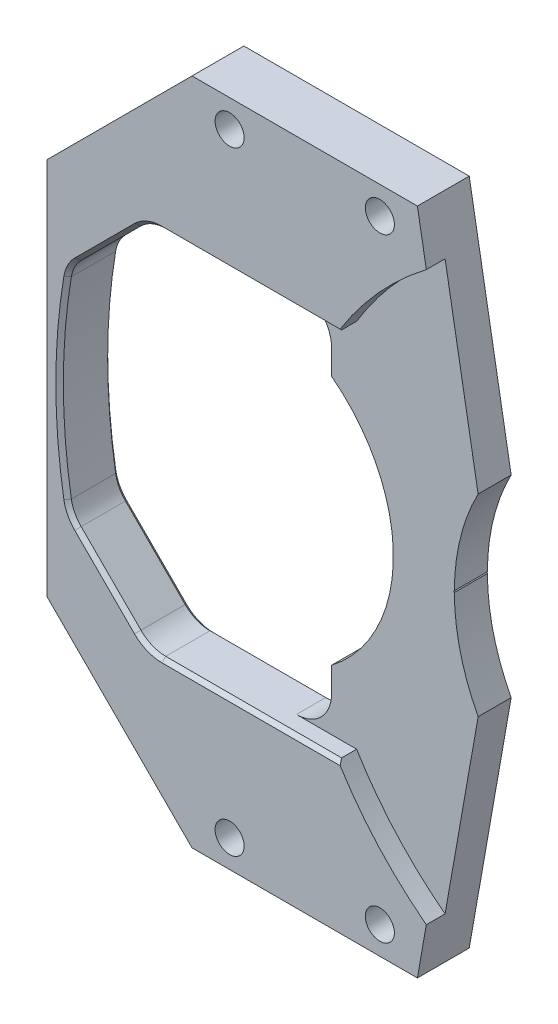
ISO-10303-21;
HEADER;
FILE_DESCRIPTION(('STEP AP214'),'2;1');
FILE_NAME('part.step','',(''),(''),'','','');
FILE_SCHEMA(('AUTOMOTIVE_DESIGN { 1 0 10303 214 1 1 1 1 }'));
ENDSEC;
DATA;
#1=APPLICATION_CONTEXT('core data for automotive mechanical design processes');
#2=APPLICATION_PROTOCOL_DEFINITION('international standard','automotive_design',2000,#1);
#3=PRODUCT_CONTEXT('',#1,'mechanical');
#4=PRODUCT('Part','Part','',(#3));
#5=PRODUCT_RELATED_PRODUCT_CATEGORY('part','',(#4));
#6=PRODUCT_DEFINITION_FORMATION('','',#4);
#7=PRODUCT_DEFINITION_CONTEXT('part definition',#1,'design');
#8=PRODUCT_DEFINITION('design','',#6,#7);
#9=PRODUCT_DEFINITION_SHAPE('','',#8);
#10=(LENGTH_UNIT() NAMED_UNIT(*) SI_UNIT(.MILLI.,.METRE.));
#11=(NAMED_UNIT(*) PLANE_ANGLE_UNIT() SI_UNIT($,.RADIAN.));
#12=(NAMED_UNIT(*) SI_UNIT($,.STERADIAN.) SOLID_ANGLE_UNIT());
#13=UNCERTAINTY_MEASURE_WITH_UNIT(LENGTH_MEASURE(1.E-05),#10,'distance_accuracy_value','');
#14=(GEOMETRIC_REPRESENTATION_CONTEXT(3) GLOBAL_UNCERTAINTY_ASSIGNED_CONTEXT((#13)) GLOBAL_UNIT_ASSIGNED_CONTEXT((#10,
#11,#12)) REPRESENTATION_CONTEXT('',''));
#15=CARTESIAN_POINT('',(0.,0.,0.));
#16=DIRECTION('',(0.,0.,1.));
#17=DIRECTION('',(1.,0.,0.));
#18=AXIS2_PLACEMENT_3D('',#15,#16,#17);
#19=CARTESIAN_POINT('',(43.18,0.,39.6139317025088));
#20=DIRECTION('',(0.,0.,-1.));
#21=DIRECTION('',(-1.,0.,0.));
#22=AXIS2_PLACEMENT_3D('',#19,#20,#21);
#23=CYLINDRICAL_SURFACE('',#22,21.0185);
#24=DIRECTION('',(0.,0.,-1.));
#25=VECTOR('',#24,1.);
#26=CARTESIAN_POINT('',(22.1616386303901,-0.0763386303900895,39.6139317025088));
#27=LINE('',#26,#25);
#28=CARTESIAN_POINT('',(22.1616386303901,-0.0763386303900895,3.3528));
#29=VERTEX_POINT('',#28);
#30=CARTESIAN_POINT('',(22.1616386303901,-0.0763386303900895,0.));
#31=VERTEX_POINT('',#30);
#32=EDGE_CURVE('E319',#29,#31,#27,.T.);
#33=ORIENTED_EDGE('',*,*,#32,.F.);
#34=CARTESIAN_POINT('',(43.18,0.,3.3528));
#35=DIRECTION('',(0.,0.,1.));
#36=DIRECTION('',(1.,0.,0.));
#37=AXIS2_PLACEMENT_3D('',#34,#35,#36);
#38=CIRCLE('',#37,21.0185);
#39=CARTESIAN_POINT('',(24.5748110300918,-9.77876708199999,3.3528));
#40=VERTEX_POINT('',#39);
#41=EDGE_CURVE('E314',#29,#40,#38,.T.);
#42=ORIENTED_EDGE('',*,*,#41,.T.);
#43=DIRECTION('',(0.,0.,-1.));
#44=VECTOR('',#43,1.);
#45=CARTESIAN_POINT('',(24.5748110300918,-9.778767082,39.6139317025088));
#46=LINE('',#45,#44);
#47=CARTESIAN_POINT('',(24.5748110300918,-9.778767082,0.));
#48=VERTEX_POINT('',#47);
#49=EDGE_CURVE('E333',#40,#48,#46,.T.);
#50=ORIENTED_EDGE('',*,*,#49,.T.);
#51=CARTESIAN_POINT('',(43.18,0.,0.));
#52=DIRECTION('',(0.,0.,1.));
#53=DIRECTION('',(-1.,0.,0.));
#54=AXIS2_PLACEMENT_3D('',#51,#52,#53);
#55=CIRCLE('',#54,21.0185);
#56=EDGE_CURVE('E346',#31,#48,#55,.T.);
#57=ORIENTED_EDGE('',*,*,#56,.F.);
#58=EDGE_LOOP('',(#33,#42,#50,#57));
#59=FACE_BOUND('',#58,.T.);
#60=ADVANCED_FACE('F30',(#59),#23,.F.);
#61=CARTESIAN_POINT('',(0.,0.,5.2578));
#62=DIRECTION('',(0.,0.,1.));
#63=DIRECTION('',(1.,0.,0.));
#64=AXIS2_PLACEMENT_3D('',#61,#62,#63);
#65=PLANE('',#64);
#66=CARTESIAN_POINT('',(1.27,-31.115,5.2578));
#67=DIRECTION('',(0.,0.,1.));
#68=DIRECTION('',(1.,0.,0.));
#69=AXIS2_PLACEMENT_3D('',#66,#67,#68);
#70=CIRCLE('',#69,1.47319999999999);
#71=CARTESIAN_POINT('',(2.74319999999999,-31.115,5.2578));
#72=VERTEX_POINT('',#71);
#73=EDGE_CURVE('E486',#72,#72,#70,.T.);
#74=ORIENTED_EDGE('',*,*,#73,.F.);
#75=EDGE_LOOP('',(#74));
#76=FACE_BOUND('',#75,.T.);
#77=CARTESIAN_POINT('',(16.51,-31.115,5.2578));
#78=DIRECTION('',(0.,0.,1.));
#79=DIRECTION('',(1.,0.,0.));
#80=AXIS2_PLACEMENT_3D('',#77,#78,#79);
#81=CIRCLE('',#80,1.47319999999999);
#82=CARTESIAN_POINT('',(17.9832,-31.115,5.2578));
#83=VERTEX_POINT('',#82);
#84=EDGE_CURVE('E479',#83,#83,#81,.T.);
#85=ORIENTED_EDGE('',*,*,#84,.F.);
#86=EDGE_LOOP('',(#85));
#87=FACE_BOUND('',#86,.T.);
#88=CARTESIAN_POINT('',(1.27,31.115,5.2578));
#89=DIRECTION('',(0.,0.,1.));
#90=DIRECTION('',(1.,0.,0.));
#91=AXIS2_PLACEMENT_3D('',#88,#89,#90);
#92=CIRCLE('',#91,1.47319999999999);
#93=CARTESIAN_POINT('',(2.74319999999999,31.115,5.2578));
#94=VERTEX_POINT('',#93);
#95=EDGE_CURVE('E492',#94,#94,#92,.T.);
#96=ORIENTED_EDGE('',*,*,#95,.F.);
#97=EDGE_LOOP('',(#96));
#98=FACE_BOUND('',#97,.T.);
#99=CARTESIAN_POINT('',(16.51,31.115,5.2578));
#100=DIRECTION('',(0.,0.,1.));
#101=DIRECTION('',(1.,0.,0.));
#102=AXIS2_PLACEMENT_3D('',#99,#100,#101);
#103=CIRCLE('',#102,1.47319999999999);
#104=CARTESIAN_POINT('',(17.9832,31.115,5.2578));
#105=VERTEX_POINT('',#104);
#106=EDGE_CURVE('E498',#105,#105,#103,.T.);
#107=ORIENTED_EDGE('',*,*,#106,.F.);
#108=EDGE_LOOP('',(#107));
#109=FACE_BOUND('',#108,.T.);
#110=DIRECTION('',(0.17364817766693,0.984807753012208,0.));
#111=VECTOR('',#110,1.);
#112=CARTESIAN_POINT('',(20.32,-33.9089995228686,5.2578));
#113=LINE('',#112,#111);
#114=CARTESIAN_POINT('',(20.32,-33.9089995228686,5.2578));
#115=VERTEX_POINT('',#114);
#116=CARTESIAN_POINT('',(21.2250819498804,-28.7760247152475,5.2578));
#117=VERTEX_POINT('',#116);
#118=EDGE_CURVE('E334',#115,#117,#113,.T.);
#119=ORIENTED_EDGE('',*,*,#118,.T.);
#120=CARTESIAN_POINT('',(43.18,0.,5.2578));
#121=DIRECTION('',(0.,0.,-1.));
#122=DIRECTION('',(1.,0.,0.));
#123=AXIS2_PLACEMENT_3D('',#120,#121,#122);
#124=CIRCLE('',#123,36.195);
#125=CARTESIAN_POINT('',(12.4827575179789,-19.177,5.2578));
#126=VERTEX_POINT('',#125);
#127=EDGE_CURVE('E672',#117,#126,#124,.T.);
#128=ORIENTED_EDGE('',*,*,#127,.T.);
#129=DIRECTION('',(-1.,0.,0.));
#130=VECTOR('',#129,1.);
#131=CARTESIAN_POINT('',(0.,-19.177,5.2578));
#132=LINE('',#131,#130);
#133=CARTESIAN_POINT('',(-5.59419420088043,-19.177,5.2578));
#134=VERTEX_POINT('',#133);
#135=EDGE_CURVE('E581',#126,#134,#132,.T.);
#136=ORIENTED_EDGE('',*,*,#135,.T.);
#137=CARTESIAN_POINT('',(-5.59419420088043,-15.24,5.2578));
#138=DIRECTION('',(0.,0.,1.));
#139=DIRECTION('',(1.,0.,0.));
#140=AXIS2_PLACEMENT_3D('',#137,#138,#139);
#141=CIRCLE('',#140,3.937);
#142=CARTESIAN_POINT('',(-8.37807359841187,-18.0238793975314,5.2578));
#143=VERTEX_POINT('',#142);
#144=EDGE_CURVE('E579',#134,#143,#141,.F.);
#145=ORIENTED_EDGE('',*,*,#144,.T.);
#146=DIRECTION('',(-0.707106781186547,0.707106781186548,0.));
#147=VECTOR('',#146,1.);
#148=CARTESIAN_POINT('',(-13.2009764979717,-13.2009764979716,5.2578));
#149=LINE('',#148,#147);
#150=CARTESIAN_POINT('',(-14.4420758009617,-11.9598771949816,5.2578));
#151=VERTEX_POINT('',#150);
#152=EDGE_CURVE('E577',#143,#151,#149,.T.);
#153=ORIENTED_EDGE('',*,*,#152,.T.);
#154=CARTESIAN_POINT('',(-11.6581964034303,-9.17599779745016,5.2578));
#155=DIRECTION('',(0.,0.,1.));
#156=DIRECTION('',(1.,0.,0.));
#157=AXIS2_PLACEMENT_3D('',#154,#155,#156);
#158=CIRCLE('',#157,3.937);
#159=CARTESIAN_POINT('',(-15.5412116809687,-9.82573724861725,5.2578));
#160=VERTEX_POINT('',#159);
#161=EDGE_CURVE('E575',#151,#160,#158,.F.);
#162=ORIENTED_EDGE('',*,*,#161,.T.);
#163=CARTESIAN_POINT('',(43.18,0.,5.2578));
#164=DIRECTION('',(0.,0.,1.));
#165=DIRECTION('',(1.,0.,0.));
#166=AXIS2_PLACEMENT_3D('',#163,#164,#165);
#167=CIRCLE('',#166,59.5376);
#168=CARTESIAN_POINT('',(-15.5412116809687,9.82573724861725,5.2578));
#169=VERTEX_POINT('',#168);
#170=EDGE_CURVE('E573',#160,#169,#167,.F.);
#171=ORIENTED_EDGE('',*,*,#170,.T.);
#172=CARTESIAN_POINT('',(-11.6581964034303,9.17599779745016,5.2578));
#173=DIRECTION('',(0.,0.,1.));
#174=DIRECTION('',(1.,0.,0.));
#175=AXIS2_PLACEMENT_3D('',#172,#173,#174);
#176=CIRCLE('',#175,3.937);
#177=CARTESIAN_POINT('',(-14.4420758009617,11.9598771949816,5.2578));
#178=VERTEX_POINT('',#177);
#179=EDGE_CURVE('E571',#169,#178,#176,.F.);
#180=ORIENTED_EDGE('',*,*,#179,.T.);
#181=DIRECTION('',(0.707106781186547,0.707106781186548,0.));
#182=VECTOR('',#181,1.);
#183=CARTESIAN_POINT('',(-8.37807359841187,18.0238793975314,5.2578));
#184=LINE('',#183,#182);
#185=CARTESIAN_POINT('',(-8.37807359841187,18.0238793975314,5.2578));
#186=VERTEX_POINT('',#185);
#187=EDGE_CURVE('E569',#178,#186,#184,.T.);
#188=ORIENTED_EDGE('',*,*,#187,.T.);
#189=CARTESIAN_POINT('',(-5.59419420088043,15.24,5.2578));
#190=DIRECTION('',(0.,0.,1.));
#191=DIRECTION('',(1.,0.,0.));
#192=AXIS2_PLACEMENT_3D('',#189,#190,#191);
#193=CIRCLE('',#192,3.937);
#194=CARTESIAN_POINT('',(-5.59419420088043,19.177,5.2578));
#195=VERTEX_POINT('',#194);
#196=EDGE_CURVE('E567',#186,#195,#193,.F.);
#197=ORIENTED_EDGE('',*,*,#196,.T.);
#198=DIRECTION('',(1.,0.,0.));
#199=VECTOR('',#198,1.);
#200=CARTESIAN_POINT('',(12.2480034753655,19.177,5.2578));
#201=LINE('',#200,#199);
#202=CARTESIAN_POINT('',(12.4827575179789,19.177,5.2578));
#203=VERTEX_POINT('',#202);
#204=EDGE_CURVE('E565',#195,#203,#201,.T.);
#205=ORIENTED_EDGE('',*,*,#204,.T.);
#206=CARTESIAN_POINT('',(43.18,0.,5.2578));
#207=DIRECTION('',(0.,0.,-1.));
#208=DIRECTION('',(1.,0.,0.));
#209=AXIS2_PLACEMENT_3D('',#206,#207,#208);
#210=CIRCLE('',#209,36.195);
#211=CARTESIAN_POINT('',(21.2250819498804,28.7760247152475,5.2578));
#212=VERTEX_POINT('',#211);
#213=EDGE_CURVE('E669',#203,#212,#210,.T.);
#214=ORIENTED_EDGE('',*,*,#213,.T.);
#215=DIRECTION('',(0.17364817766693,-0.984807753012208,0.));
#216=VECTOR('',#215,1.);
#217=CARTESIAN_POINT('',(20.32,33.9089995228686,5.2578));
#218=LINE('',#217,#216);
#219=CARTESIAN_POINT('',(20.32,33.9089995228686,5.2578));
#220=VERTEX_POINT('',#219);
#221=EDGE_CURVE('E349',#220,#212,#218,.T.);
#222=ORIENTED_EDGE('',*,*,#221,.F.);
#223=DIRECTION('',(-1.,0.,0.));
#224=VECTOR('',#223,1.);
#225=CARTESIAN_POINT('',(-2.54,33.909,5.2578));
#226=LINE('',#225,#224);
#227=CARTESIAN_POINT('',(-2.54,33.909,5.2578));
#228=VERTEX_POINT('',#227);
#229=EDGE_CURVE('E671',#220,#228,#226,.T.);
#230=ORIENTED_EDGE('',*,*,#229,.T.);
#231=DIRECTION('',(0.707106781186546,0.707106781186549,0.));
#232=VECTOR('',#231,1.);
#233=CARTESIAN_POINT('',(-2.54,33.909,5.2578));
#234=LINE('',#233,#232);
#235=CARTESIAN_POINT('',(-17.272,19.177,5.2578));
#236=VERTEX_POINT('',#235);
#237=EDGE_CURVE('E477',#236,#228,#234,.T.);
#238=ORIENTED_EDGE('',*,*,#237,.F.);
#239=DIRECTION('',(0.,-1.,0.));
#240=VECTOR('',#239,1.);
#241=CARTESIAN_POINT('',(-17.272,0.,5.2578));
#242=LINE('',#241,#240);
#243=CARTESIAN_POINT('',(-17.272,-19.177,5.25780000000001));
#244=VERTEX_POINT('',#243);
#245=EDGE_CURVE('E554',#236,#244,#242,.T.);
#246=ORIENTED_EDGE('',*,*,#245,.T.);
#247=DIRECTION('',(0.707106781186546,-0.707106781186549,0.));
#248=VECTOR('',#247,1.);
#249=CARTESIAN_POINT('',(-2.54,-33.909,5.2578));
#250=LINE('',#249,#248);
#251=CARTESIAN_POINT('',(-2.54,-33.909,5.2578));
#252=VERTEX_POINT('',#251);
#253=EDGE_CURVE('E467',#244,#252,#250,.T.);
#254=ORIENTED_EDGE('',*,*,#253,.T.);
#255=DIRECTION('',(1.,0.,0.));
#256=VECTOR('',#255,1.);
#257=CARTESIAN_POINT('',(-2.54,-33.909,5.2578));
#258=LINE('',#257,#256);
#259=EDGE_CURVE('E563',#252,#115,#258,.T.);
#260=ORIENTED_EDGE('',*,*,#259,.T.);
#261=EDGE_LOOP('',(#119,#128,#136,#145,#153,#162,#171,#180,#188,#197,#205,#214,#222,#230,#238,
#246,#254,#260));
#262=FACE_BOUND('',#261,.T.);
#263=ADVANCED_FACE('F811',(#76,#87,#98,#109,#262),#65,.T.);
#264=CARTESIAN_POINT('',(20.32,33.9089995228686,39.6139317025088));
#265=DIRECTION('',(0.984807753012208,0.17364817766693,0.));
#266=DIRECTION('',(-0.17364817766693,0.984807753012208,0.));
#267=AXIS2_PLACEMENT_3D('',#264,#265,#266);
#268=PLANE('',#267);
#269=ORIENTED_EDGE('',*,*,#221,.T.);
#270=DIRECTION('',(0.,0.,-1.));
#271=VECTOR('',#270,1.);
#272=CARTESIAN_POINT('',(21.2250819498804,28.7760247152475,5.25785));
#273=LINE('',#272,#271);
#274=CARTESIAN_POINT('',(21.2250819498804,28.7760247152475,3.3528));
#275=VERTEX_POINT('',#274);
#276=EDGE_CURVE('E326',#212,#275,#273,.T.);
#277=ORIENTED_EDGE('',*,*,#276,.T.);
#278=DIRECTION('',(0.17364817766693,-0.984807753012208,0.));
#279=VECTOR('',#278,1.);
#280=CARTESIAN_POINT('',(20.32,33.9089995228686,3.3528));
#281=LINE('',#280,#279);
#282=CARTESIAN_POINT('',(24.5748110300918,9.778767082,3.3528));
#283=VERTEX_POINT('',#282);
#284=EDGE_CURVE('E323',#275,#283,#281,.T.);
#285=ORIENTED_EDGE('',*,*,#284,.T.);
#286=DIRECTION('',(0.,0.,-1.));
#287=VECTOR('',#286,1.);
#288=CARTESIAN_POINT('',(24.5748110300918,9.778767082,39.6139317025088));
#289=LINE('',#288,#287);
#290=CARTESIAN_POINT('',(24.5748110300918,9.778767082,0.));
#291=VERTEX_POINT('',#290);
#292=EDGE_CURVE('E352',#283,#291,#289,.T.);
#293=ORIENTED_EDGE('',*,*,#292,.T.);
#294=DIRECTION('',(0.17364817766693,-0.984807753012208,0.));
#295=VECTOR('',#294,1.);
#296=CARTESIAN_POINT('',(20.32,33.9089995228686,0.));
#297=LINE('',#296,#295);
#298=CARTESIAN_POINT('',(20.32,33.9089995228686,0.));
#299=VERTEX_POINT('',#298);
#300=EDGE_CURVE('E337',#299,#291,#297,.T.);
#301=ORIENTED_EDGE('',*,*,#300,.F.);
#302=DIRECTION('',(0.,0.,-1.));
#303=VECTOR('',#302,1.);
#304=CARTESIAN_POINT('',(20.32,33.9089995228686,39.6139317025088));
#305=LINE('',#304,#303);
#306=EDGE_CURVE('E345',#220,#299,#305,.T.);
#307=ORIENTED_EDGE('',*,*,#306,.F.);
#308=EDGE_LOOP('',(#269,#277,#285,#293,#301,#307));
#309=FACE_BOUND('',#308,.T.);
#310=ADVANCED_FACE('F696',(#309),#268,.T.);
#311=DIRECTION('',(0.,0.,-1.));
#312=VECTOR('',#311,1.);
#313=CARTESIAN_POINT('',(22.1616386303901,0.0763386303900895,39.6139317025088));
#314=LINE('',#313,#312);
#315=CARTESIAN_POINT('',(22.1616386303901,0.0763386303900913,0.));
#316=VERTEX_POINT('',#315);
#317=CARTESIAN_POINT('',(22.1616386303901,0.0763386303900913,3.3528));
#318=VERTEX_POINT('',#317);
#319=EDGE_CURVE('E305',#316,#318,#314,.F.);
#320=ORIENTED_EDGE('',*,*,#319,.F.);
#321=EDGE_CURVE('E342',#291,#316,#55,.T.);
#322=ORIENTED_EDGE('',*,*,#321,.F.);
#323=ORIENTED_EDGE('',*,*,#292,.F.);
#324=EDGE_CURVE('E321',#283,#318,#38,.T.);
#325=ORIENTED_EDGE('',*,*,#324,.T.);
#326=EDGE_LOOP('',(#320,#322,#323,#325));
#327=FACE_BOUND('',#326,.T.);
#328=ADVANCED_FACE('F691',(#327),#23,.F.);
#329=CARTESIAN_POINT('',(20.32,-33.9089995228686,39.6139317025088));
#330=DIRECTION('',(-0.984807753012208,0.17364817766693,0.));
#331=DIRECTION('',(-0.17364817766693,-0.984807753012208,0.));
#332=AXIS2_PLACEMENT_3D('',#329,#330,#331);
#333=PLANE('',#332);
#334=DIRECTION('',(0.,0.,-1.));
#335=VECTOR('',#334,1.);
#336=CARTESIAN_POINT('',(21.2250819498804,-28.7760247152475,5.25785));
#337=LINE('',#336,#335);
#338=CARTESIAN_POINT('',(21.2250819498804,-28.7760247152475,3.3528));
#339=VERTEX_POINT('',#338);
#340=EDGE_CURVE('E38',#117,#339,#337,.T.);
#341=ORIENTED_EDGE('',*,*,#340,.F.);
#342=ORIENTED_EDGE('',*,*,#118,.F.);
#343=DIRECTION('',(0.,0.,-1.));
#344=VECTOR('',#343,1.);
#345=CARTESIAN_POINT('',(20.32,-33.9089995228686,39.6139317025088));
#346=LINE('',#345,#344);
#347=CARTESIAN_POINT('',(20.32,-33.9089995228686,0.));
#348=VERTEX_POINT('',#347);
#349=EDGE_CURVE('E329',#115,#348,#346,.T.);
#350=ORIENTED_EDGE('',*,*,#349,.T.);
#351=DIRECTION('',(0.17364817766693,0.984807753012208,0.));
#352=VECTOR('',#351,1.);
#353=CARTESIAN_POINT('',(20.32,-33.9089995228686,0.));
#354=LINE('',#353,#352);
#355=EDGE_CURVE('E330',#348,#48,#354,.T.);
#356=ORIENTED_EDGE('',*,*,#355,.T.);
#357=ORIENTED_EDGE('',*,*,#49,.F.);
#358=DIRECTION('',(0.17364817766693,0.984807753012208,0.));
#359=VECTOR('',#358,1.);
#360=CARTESIAN_POINT('',(20.32,-33.9089995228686,3.3528));
#361=LINE('',#360,#359);
#362=EDGE_CURVE('E668',#339,#40,#361,.T.);
#363=ORIENTED_EDGE('',*,*,#362,.F.);
#364=EDGE_LOOP('',(#341,#342,#350,#356,#357,#363));
#365=FACE_BOUND('',#364,.T.);
#366=ADVANCED_FACE('F683',(#365),#333,.F.);
#367=CARTESIAN_POINT('',(9.7028,-18.796,5.257825));
#368=DIRECTION('',(-1.,0.,0.));
#369=DIRECTION('',(0.,-1.,0.));
#370=AXIS2_PLACEMENT_3D('',#367,#368,#369);
#371=PLANE('',#370);
#372=DIRECTION('',(0.,0.,-1.));
#373=VECTOR('',#372,1.);
#374=CARTESIAN_POINT('',(9.7028,-12.6928097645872,3.3528));
#375=LINE('',#374,#373);
#376=CARTESIAN_POINT('',(9.7028,-12.6928097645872,0.380999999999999));
#377=VERTEX_POINT('',#376);
#378=CARTESIAN_POINT('',(9.7028,-12.6928097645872,3.3528));
#379=VERTEX_POINT('',#378);
#380=EDGE_CURVE('E457',#377,#379,#375,.F.);
#381=ORIENTED_EDGE('',*,*,#380,.F.);
#382=DIRECTION('',(0.,-1.,0.));
#383=VECTOR('',#382,1.);
#384=CARTESIAN_POINT('',(9.7028,-15.24,0.380999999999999));
#385=LINE('',#384,#383);
#386=CARTESIAN_POINT('',(9.7028,-15.24,0.380999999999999));
#387=VERTEX_POINT('',#386);
#388=EDGE_CURVE('E664',#377,#387,#385,.T.);
#389=ORIENTED_EDGE('',*,*,#388,.T.);
#390=DIRECTION('',(0.,0.,-1.));
#391=VECTOR('',#390,1.);
#392=CARTESIAN_POINT('',(9.7028,-15.24,5.2578));
#393=LINE('',#392,#391);
#394=CARTESIAN_POINT('',(9.7028,-15.24,3.3528));
#395=VERTEX_POINT('',#394);
#396=EDGE_CURVE('E546',#387,#395,#393,.F.);
#397=ORIENTED_EDGE('',*,*,#396,.T.);
#398=DIRECTION('',(0.,-1.,0.));
#399=VECTOR('',#398,1.);
#400=CARTESIAN_POINT('',(9.7028,0.,3.3528));
#401=LINE('',#400,#399);
#402=EDGE_CURVE('E455',#379,#395,#401,.T.);
#403=ORIENTED_EDGE('',*,*,#402,.F.);
#404=EDGE_LOOP('',(#381,#389,#397,#403));
#405=FACE_BOUND('',#404,.T.);
#406=ADVANCED_FACE('F734',(#405),#371,.T.);
#407=CARTESIAN_POINT('',(6.1468,-15.24,5.257825));
#408=DIRECTION('',(0.,0.,1.));
#409=DIRECTION('',(1.,0.,0.));
#410=AXIS2_PLACEMENT_3D('',#407,#408,#409);
#411=CYLINDRICAL_SURFACE('',#410,3.556);
#412=ORIENTED_EDGE('',*,*,#396,.F.);
#413=CARTESIAN_POINT('',(6.1468,-15.24,0.380999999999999));
#414=DIRECTION('',(0.,0.,1.));
#415=DIRECTION('',(1.,0.,0.));
#416=AXIS2_PLACEMENT_3D('',#413,#414,#415);
#417=CIRCLE('',#416,3.556);
#418=CARTESIAN_POINT('',(6.1468,-18.796,0.380999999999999));
#419=VERTEX_POINT('',#418);
#420=EDGE_CURVE('E662',#387,#419,#417,.F.);
#421=ORIENTED_EDGE('',*,*,#420,.T.);
#422=DIRECTION('',(0.,0.,-1.));
#423=VECTOR('',#422,1.);
#424=CARTESIAN_POINT('',(6.1468,-18.796,0.));
#425=LINE('',#424,#423);
#426=CARTESIAN_POINT('',(6.1468,-18.796,3.3528));
#427=VERTEX_POINT('',#426);
#428=EDGE_CURVE('E541',#427,#419,#425,.T.);
#429=ORIENTED_EDGE('',*,*,#428,.F.);
#430=CARTESIAN_POINT('',(6.1468,-15.24,3.3528));
#431=DIRECTION('',(0.,0.,1.));
#432=DIRECTION('',(1.,0.,0.));
#433=AXIS2_PLACEMENT_3D('',#430,#431,#432);
#434=CIRCLE('',#433,3.556);
#435=EDGE_CURVE('E561',#395,#427,#434,.F.);
#436=ORIENTED_EDGE('',*,*,#435,.F.);
#437=EDGE_LOOP('',(#412,#421,#429,#436));
#438=FACE_BOUND('',#437,.T.);
#439=ADVANCED_FACE('F746',(#438),#411,.F.);
#440=CARTESIAN_POINT('',(43.18,0.,5.2578));
#441=DIRECTION('',(0.,0.,-1.));
#442=DIRECTION('',(-1.,0.,0.));
#443=AXIS2_PLACEMENT_3D('',#440,#441,#442);
#444=CYLINDRICAL_SURFACE('',#443,36.195);
#445=ORIENTED_EDGE('',*,*,#213,.F.);
#446=CARTESIAN_POINT('',(43.18,0.,-13.9191999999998));
#447=DIRECTION('',(0.,-0.707106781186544,0.707106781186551));
#448=DIRECTION('',(0.,-0.707106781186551,-0.707106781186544));
#449=AXIS2_PLACEMENT_3D('',#446,#447,#448);
#450=ELLIPSE('',#449,51.187459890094,36.195);
#451=CARTESIAN_POINT('',(12.2480034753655,18.796,4.8768));
#452=VERTEX_POINT('',#451);
#453=EDGE_CURVE('E608',#203,#452,#450,.T.);
#454=ORIENTED_EDGE('',*,*,#453,.T.);
#455=DIRECTION('',(0.,0.,-1.));
#456=VECTOR('',#455,1.);
#457=CARTESIAN_POINT('',(12.2480034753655,18.796,5.2578));
#458=LINE('',#457,#456);
#459=CARTESIAN_POINT('',(12.2480034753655,18.796,3.3528));
#460=VERTEX_POINT('',#459);
#461=EDGE_CURVE('E452',#460,#452,#458,.F.);
#462=ORIENTED_EDGE('',*,*,#461,.F.);
#463=CARTESIAN_POINT('',(43.18,0.,3.3528));
#464=DIRECTION('',(0.,0.,-1.));
#465=DIRECTION('',(1.,0.,0.));
#466=AXIS2_PLACEMENT_3D('',#463,#464,#465);
#467=CIRCLE('',#466,36.195);
#468=EDGE_CURVE('E511',#460,#275,#467,.T.);
#469=ORIENTED_EDGE('',*,*,#468,.T.);
#470=ORIENTED_EDGE('',*,*,#276,.F.);
#471=EDGE_LOOP('',(#445,#454,#462,#469,#470));
#472=FACE_BOUND('',#471,.T.);
#473=ADVANCED_FACE('F703',(#472),#444,.F.);
#474=CARTESIAN_POINT('',(9.7028,18.796,5.257825));
#475=DIRECTION('',(1.,0.,0.));
#476=DIRECTION('',(0.,1.,0.));
#477=AXIS2_PLACEMENT_3D('',#474,#475,#476);
#478=PLANE('',#477);
#479=DIRECTION('',(0.,0.,-1.));
#480=VECTOR('',#479,1.);
#481=CARTESIAN_POINT('',(9.7028,15.24,0.));
#482=LINE('',#481,#480);
#483=CARTESIAN_POINT('',(9.7028,15.24,3.3528));
#484=VERTEX_POINT('',#483);
#485=CARTESIAN_POINT('',(9.7028,15.24,0.380999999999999));
#486=VERTEX_POINT('',#485);
#487=EDGE_CURVE('E527',#484,#486,#482,.T.);
#488=ORIENTED_EDGE('',*,*,#487,.T.);
#489=DIRECTION('',(0.,-1.,0.));
#490=VECTOR('',#489,1.);
#491=CARTESIAN_POINT('',(9.7028,18.796,0.380999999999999));
#492=LINE('',#491,#490);
#493=CARTESIAN_POINT('',(9.7028,12.6928097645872,0.380999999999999));
#494=VERTEX_POINT('',#493);
#495=EDGE_CURVE('E610',#486,#494,#492,.T.);
#496=ORIENTED_EDGE('',*,*,#495,.T.);
#497=DIRECTION('',(0.,0.,-1.));
#498=VECTOR('',#497,1.);
#499=CARTESIAN_POINT('',(9.7028,12.6928097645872,3.3528));
#500=LINE('',#499,#498);
#501=CARTESIAN_POINT('',(9.7028,12.6928097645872,3.3528));
#502=VERTEX_POINT('',#501);
#503=EDGE_CURVE('E461',#494,#502,#500,.F.);
#504=ORIENTED_EDGE('',*,*,#503,.T.);
#505=DIRECTION('',(0.,1.,0.));
#506=VECTOR('',#505,1.);
#507=CARTESIAN_POINT('',(9.7028,0.,3.3528));
#508=LINE('',#507,#506);
#509=EDGE_CURVE('E459',#502,#484,#508,.T.);
#510=ORIENTED_EDGE('',*,*,#509,.T.);
#511=EDGE_LOOP('',(#488,#496,#504,#510));
#512=FACE_BOUND('',#511,.T.);
#513=ADVANCED_FACE('F717',(#512),#478,.F.);
#514=CARTESIAN_POINT('',(6.1468,15.24,5.257825));
#515=DIRECTION('',(0.,0.,1.));
#516=DIRECTION('',(1.,0.,0.));
#517=AXIS2_PLACEMENT_3D('',#514,#515,#516);
#518=CYLINDRICAL_SURFACE('',#517,3.556);
#519=DIRECTION('',(0.,0.,-1.));
#520=VECTOR('',#519,1.);
#521=CARTESIAN_POINT('',(6.1468,18.796,5.2578));
#522=LINE('',#521,#520);
#523=CARTESIAN_POINT('',(6.1468,18.796,0.380999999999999));
#524=VERTEX_POINT('',#523);
#525=CARTESIAN_POINT('',(6.1468,18.796,3.3528));
#526=VERTEX_POINT('',#525);
#527=EDGE_CURVE('E522',#524,#526,#522,.F.);
#528=ORIENTED_EDGE('',*,*,#527,.F.);
#529=CARTESIAN_POINT('',(6.1468,15.24,0.380999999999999));
#530=DIRECTION('',(0.,0.,1.));
#531=DIRECTION('',(1.,0.,0.));
#532=AXIS2_PLACEMENT_3D('',#529,#530,#531);
#533=CIRCLE('',#532,3.556);
#534=EDGE_CURVE('E642',#524,#486,#533,.F.);
#535=ORIENTED_EDGE('',*,*,#534,.T.);
#536=ORIENTED_EDGE('',*,*,#487,.F.);
#537=CARTESIAN_POINT('',(6.1468,15.24,3.3528));
#538=DIRECTION('',(0.,0.,1.));
#539=DIRECTION('',(1.,0.,0.));
#540=AXIS2_PLACEMENT_3D('',#537,#538,#539);
#541=CIRCLE('',#540,3.556);
#542=EDGE_CURVE('E558',#526,#484,#541,.F.);
#543=ORIENTED_EDGE('',*,*,#542,.F.);
#544=EDGE_LOOP('',(#528,#535,#536,#543));
#545=FACE_BOUND('',#544,.T.);
#546=ADVANCED_FACE('F712',(#545),#518,.F.);
#547=CARTESIAN_POINT('',(0.,0.,3.3528));
#548=DIRECTION('',(0.,0.,1.));
#549=DIRECTION('',(1.,0.,0.));
#550=AXIS2_PLACEMENT_3D('',#547,#548,#549);
#551=PLANE('',#550);
#552=DIRECTION('',(0.707106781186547,-0.707106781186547,0.));
#553=VECTOR('',#552,1.);
#554=CARTESIAN_POINT('',(22.0853,0.,3.3528));
#555=LINE('',#554,#553);
#556=CARTESIAN_POINT('',(22.0853,0.,3.3528));
#557=VERTEX_POINT('',#556);
#558=EDGE_CURVE('E308',#557,#29,#555,.T.);
#559=ORIENTED_EDGE('',*,*,#558,.F.);
#560=DIRECTION('',(-0.707106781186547,-0.707106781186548,0.));
#561=VECTOR('',#560,1.);
#562=CARTESIAN_POINT('',(22.0853,0.,3.3528));
#563=LINE('',#562,#561);
#564=EDGE_CURVE('E301',#318,#557,#563,.T.);
#565=ORIENTED_EDGE('',*,*,#564,.F.);
#566=ORIENTED_EDGE('',*,*,#324,.F.);
#567=ORIENTED_EDGE('',*,*,#284,.F.);
#568=ORIENTED_EDGE('',*,*,#468,.F.);
#569=DIRECTION('',(-1.,0.,0.));
#570=VECTOR('',#569,1.);
#571=CARTESIAN_POINT('',(3.93345210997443,18.796,3.3528));
#572=LINE('',#571,#570);
#573=EDGE_CURVE('E449',#460,#526,#572,.T.);
#574=ORIENTED_EDGE('',*,*,#573,.T.);
#575=ORIENTED_EDGE('',*,*,#542,.T.);
#576=ORIENTED_EDGE('',*,*,#509,.F.);
#577=CARTESIAN_POINT('',(0.,0.,3.3528));
#578=DIRECTION('',(0.,0.,1.));
#579=DIRECTION('',(1.,0.,0.));
#580=AXIS2_PLACEMENT_3D('',#577,#578,#579);
#581=CIRCLE('',#580,15.9766);
#582=EDGE_CURVE('E517',#379,#502,#581,.T.);
#583=ORIENTED_EDGE('',*,*,#582,.F.);
#584=ORIENTED_EDGE('',*,*,#402,.T.);
#585=ORIENTED_EDGE('',*,*,#435,.T.);
#586=DIRECTION('',(-1.,0.,0.));
#587=VECTOR('',#586,1.);
#588=CARTESIAN_POINT('',(3.93345210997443,-18.796,3.3528));
#589=LINE('',#588,#587);
#590=CARTESIAN_POINT('',(12.2480034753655,-18.796,3.3528));
#591=VERTEX_POINT('',#590);
#592=EDGE_CURVE('E443',#591,#427,#589,.T.);
#593=ORIENTED_EDGE('',*,*,#592,.F.);
#594=CARTESIAN_POINT('',(43.18,0.,3.3528));
#595=DIRECTION('',(0.,0.,-1.));
#596=DIRECTION('',(1.,0.,0.));
#597=AXIS2_PLACEMENT_3D('',#594,#595,#596);
#598=CIRCLE('',#597,36.195);
#599=EDGE_CURVE('E53',#339,#591,#598,.T.);
#600=ORIENTED_EDGE('',*,*,#599,.F.);
#601=ORIENTED_EDGE('',*,*,#362,.T.);
#602=ORIENTED_EDGE('',*,*,#41,.F.);
#603=EDGE_LOOP('',(#559,#565,#566,#567,#568,#574,#575,#576,#583,#584,#585,#593,#600,#601,#602));
#604=FACE_BOUND('',#603,.T.);
#605=ADVANCED_FACE('F32',(#604),#551,.T.);
#606=CARTESIAN_POINT('',(0.,0.,0.));
#607=DIRECTION('',(0.,0.,1.));
#608=DIRECTION('',(1.,0.,0.));
#609=AXIS2_PLACEMENT_3D('',#606,#607,#608);
#610=PLANE('',#609);
#611=CARTESIAN_POINT('',(0.,0.,0.));
#612=DIRECTION('',(0.,0.,1.));
#613=DIRECTION('',(1.,0.,0.));
#614=AXIS2_PLACEMENT_3D('',#611,#612,#613);
#615=CIRCLE('',#614,16.3576);
#616=CARTESIAN_POINT('',(10.0838,-12.8797536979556,0.));
#617=VERTEX_POINT('',#616);
#618=CARTESIAN_POINT('',(10.0838,12.8797536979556,0.));
#619=VERTEX_POINT('',#618);
#620=EDGE_CURVE('E613',#617,#619,#615,.T.);
#621=ORIENTED_EDGE('',*,*,#620,.T.);
#622=DIRECTION('',(0.,1.,0.));
#623=VECTOR('',#622,1.);
#624=CARTESIAN_POINT('',(10.0838,0.,0.));
#625=LINE('',#624,#623);
#626=CARTESIAN_POINT('',(10.0838,15.24,0.));
#627=VERTEX_POINT('',#626);
#628=EDGE_CURVE('E639',#619,#627,#625,.T.);
#629=ORIENTED_EDGE('',*,*,#628,.T.);
#630=CARTESIAN_POINT('',(6.1468,15.24,0.));
#631=DIRECTION('',(0.,0.,1.));
#632=DIRECTION('',(1.,0.,0.));
#633=AXIS2_PLACEMENT_3D('',#630,#631,#632);
#634=CIRCLE('',#633,3.937);
#635=CARTESIAN_POINT('',(6.1468,19.177,0.));
#636=VERTEX_POINT('',#635);
#637=EDGE_CURVE('E637',#627,#636,#634,.T.);
#638=ORIENTED_EDGE('',*,*,#637,.T.);
#639=DIRECTION('',(-1.,0.,0.));
#640=VECTOR('',#639,1.);
#641=CARTESIAN_POINT('',(0.,19.177,0.));
#642=LINE('',#641,#640);
#643=CARTESIAN_POINT('',(-5.59419420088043,19.177,0.));
#644=VERTEX_POINT('',#643);
#645=EDGE_CURVE('E635',#636,#644,#642,.T.);
#646=ORIENTED_EDGE('',*,*,#645,.T.);
#647=CARTESIAN_POINT('',(-5.59419420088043,15.24,0.));
#648=DIRECTION('',(0.,0.,1.));
#649=DIRECTION('',(1.,0.,0.));
#650=AXIS2_PLACEMENT_3D('',#647,#648,#649);
#651=CIRCLE('',#650,3.937);
#652=CARTESIAN_POINT('',(-8.37807359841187,18.0238793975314,0.));
#653=VERTEX_POINT('',#652);
#654=EDGE_CURVE('E633',#644,#653,#651,.T.);
#655=ORIENTED_EDGE('',*,*,#654,.T.);
#656=DIRECTION('',(-0.707106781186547,-0.707106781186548,0.));
#657=VECTOR('',#656,1.);
#658=CARTESIAN_POINT('',(-13.2009764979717,13.2009764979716,0.));
#659=LINE('',#658,#657);
#660=CARTESIAN_POINT('',(-14.4420758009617,11.9598771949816,0.));
#661=VERTEX_POINT('',#660);
#662=EDGE_CURVE('E631',#653,#661,#659,.T.);
#663=ORIENTED_EDGE('',*,*,#662,.T.);
#664=CARTESIAN_POINT('',(-11.6581964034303,9.17599779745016,0.));
#665=DIRECTION('',(0.,0.,1.));
#666=DIRECTION('',(1.,0.,0.));
#667=AXIS2_PLACEMENT_3D('',#664,#665,#666);
#668=CIRCLE('',#667,3.937);
#669=CARTESIAN_POINT('',(-15.5412116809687,9.82573724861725,0.));
#670=VERTEX_POINT('',#669);
#671=EDGE_CURVE('E629',#661,#670,#668,.T.);
#672=ORIENTED_EDGE('',*,*,#671,.T.);
#673=CARTESIAN_POINT('',(43.18,0.,0.));
#674=DIRECTION('',(0.,0.,1.));
#675=DIRECTION('',(1.,0.,0.));
#676=AXIS2_PLACEMENT_3D('',#673,#674,#675);
#677=CIRCLE('',#676,59.5376);
#678=CARTESIAN_POINT('',(-15.5412116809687,-9.82573724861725,0.));
#679=VERTEX_POINT('',#678);
#680=EDGE_CURVE('E627',#670,#679,#677,.T.);
#681=ORIENTED_EDGE('',*,*,#680,.T.);
#682=CARTESIAN_POINT('',(-11.6581964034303,-9.17599779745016,0.));
#683=DIRECTION('',(0.,0.,1.));
#684=DIRECTION('',(1.,0.,0.));
#685=AXIS2_PLACEMENT_3D('',#682,#683,#684);
#686=CIRCLE('',#685,3.937);
#687=CARTESIAN_POINT('',(-14.4420758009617,-11.9598771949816,0.));
#688=VERTEX_POINT('',#687);
#689=EDGE_CURVE('E625',#679,#688,#686,.T.);
#690=ORIENTED_EDGE('',*,*,#689,.T.);
#691=DIRECTION('',(0.707106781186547,-0.707106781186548,0.));
#692=VECTOR('',#691,1.);
#693=CARTESIAN_POINT('',(-8.37807359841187,-18.0238793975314,0.));
#694=LINE('',#693,#692);
#695=CARTESIAN_POINT('',(-8.37807359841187,-18.0238793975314,0.));
#696=VERTEX_POINT('',#695);
#697=EDGE_CURVE('E623',#688,#696,#694,.T.);
#698=ORIENTED_EDGE('',*,*,#697,.T.);
#699=CARTESIAN_POINT('',(-5.59419420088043,-15.24,0.));
#700=DIRECTION('',(0.,0.,1.));
#701=DIRECTION('',(1.,0.,0.));
#702=AXIS2_PLACEMENT_3D('',#699,#700,#701);
#703=CIRCLE('',#702,3.937);
#704=CARTESIAN_POINT('',(-5.59419420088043,-19.177,0.));
#705=VERTEX_POINT('',#704);
#706=EDGE_CURVE('E621',#696,#705,#703,.T.);
#707=ORIENTED_EDGE('',*,*,#706,.T.);
#708=DIRECTION('',(1.,0.,0.));
#709=VECTOR('',#708,1.);
#710=CARTESIAN_POINT('',(6.1468,-19.177,0.));
#711=LINE('',#710,#709);
#712=CARTESIAN_POINT('',(6.1468,-19.177,0.));
#713=VERTEX_POINT('',#712);
#714=EDGE_CURVE('E619',#705,#713,#711,.T.);
#715=ORIENTED_EDGE('',*,*,#714,.T.);
#716=CARTESIAN_POINT('',(6.1468,-15.24,0.));
#717=DIRECTION('',(0.,0.,1.));
#718=DIRECTION('',(1.,0.,0.));
#719=AXIS2_PLACEMENT_3D('',#716,#717,#718);
#720=CIRCLE('',#719,3.937);
#721=CARTESIAN_POINT('',(10.0838,-15.24,0.));
#722=VERTEX_POINT('',#721);
#723=EDGE_CURVE('E617',#713,#722,#720,.T.);
#724=ORIENTED_EDGE('',*,*,#723,.T.);
#725=DIRECTION('',(0.,1.,0.));
#726=VECTOR('',#725,1.);
#727=CARTESIAN_POINT('',(10.0838,-12.6928097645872,0.));
#728=LINE('',#727,#726);
#729=EDGE_CURVE('E615',#722,#617,#728,.T.);
#730=ORIENTED_EDGE('',*,*,#729,.T.);
#731=EDGE_LOOP('',(#621,#629,#638,#646,#655,#663,#672,#681,#690,#698,#707,#715,#724,#730));
#732=FACE_BOUND('',#731,.T.);
#733=CARTESIAN_POINT('',(16.51,-31.115,0.));
#734=DIRECTION('',(0.,0.,1.));
#735=DIRECTION('',(1.,0.,0.));
#736=AXIS2_PLACEMENT_3D('',#733,#734,#735);
#737=CIRCLE('',#736,1.4732);
#738=CARTESIAN_POINT('',(17.9832,-31.115,0.));
#739=VERTEX_POINT('',#738);
#740=EDGE_CURVE('E483',#739,#739,#737,.T.);
#741=ORIENTED_EDGE('',*,*,#740,.T.);
#742=EDGE_LOOP('',(#741));
#743=FACE_BOUND('',#742,.T.);
#744=CARTESIAN_POINT('',(1.27,-31.115,0.));
#745=DIRECTION('',(0.,0.,1.));
#746=DIRECTION('',(1.,0.,0.));
#747=AXIS2_PLACEMENT_3D('',#744,#745,#746);
#748=CIRCLE('',#747,1.4732);
#749=CARTESIAN_POINT('',(2.7432,-31.115,0.));
#750=VERTEX_POINT('',#749);
#751=EDGE_CURVE('E489',#750,#750,#748,.T.);
#752=ORIENTED_EDGE('',*,*,#751,.T.);
#753=EDGE_LOOP('',(#752));
#754=FACE_BOUND('',#753,.T.);
#755=CARTESIAN_POINT('',(1.27,31.115,0.));
#756=DIRECTION('',(0.,0.,1.));
#757=DIRECTION('',(1.,0.,0.));
#758=AXIS2_PLACEMENT_3D('',#755,#756,#757);
#759=CIRCLE('',#758,1.4732);
#760=CARTESIAN_POINT('',(2.7432,31.115,0.));
#761=VERTEX_POINT('',#760);
#762=EDGE_CURVE('E495',#761,#761,#759,.T.);
#763=ORIENTED_EDGE('',*,*,#762,.T.);
#764=EDGE_LOOP('',(#763));
#765=FACE_BOUND('',#764,.T.);
#766=CARTESIAN_POINT('',(16.51,31.115,0.));
#767=DIRECTION('',(0.,0.,1.));
#768=DIRECTION('',(1.,0.,0.));
#769=AXIS2_PLACEMENT_3D('',#766,#767,#768);
#770=CIRCLE('',#769,1.4732);
#771=CARTESIAN_POINT('',(17.9832,31.115,0.));
#772=VERTEX_POINT('',#771);
#773=EDGE_CURVE('E501',#772,#772,#770,.T.);
#774=ORIENTED_EDGE('',*,*,#773,.T.);
#775=EDGE_LOOP('',(#774));
#776=FACE_BOUND('',#775,.T.);
#777=DIRECTION('',(-0.707106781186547,-0.707106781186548,0.));
#778=VECTOR('',#777,1.);
#779=CARTESIAN_POINT('',(11.04265,-11.04265,0.));
#780=LINE('',#779,#778);
#781=CARTESIAN_POINT('',(22.0853,0.,0.));
#782=VERTEX_POINT('',#781);
#783=EDGE_CURVE('E11',#316,#782,#780,.T.);
#784=ORIENTED_EDGE('',*,*,#783,.T.);
#785=DIRECTION('',(0.707106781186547,-0.707106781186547,0.));
#786=VECTOR('',#785,1.);
#787=CARTESIAN_POINT('',(22.0853,0.,0.));
#788=LINE('',#787,#786);
#789=EDGE_CURVE('E45',#782,#31,#788,.T.);
#790=ORIENTED_EDGE('',*,*,#789,.T.);
#791=ORIENTED_EDGE('',*,*,#56,.T.);
#792=ORIENTED_EDGE('',*,*,#355,.F.);
#793=DIRECTION('',(-1.,0.,0.));
#794=VECTOR('',#793,1.);
#795=CARTESIAN_POINT('',(-2.54,-33.909,0.));
#796=LINE('',#795,#794);
#797=CARTESIAN_POINT('',(-2.54,-33.909,0.));
#798=VERTEX_POINT('',#797);
#799=EDGE_CURVE('E816',#348,#798,#796,.T.);
#800=ORIENTED_EDGE('',*,*,#799,.T.);
#801=DIRECTION('',(0.707106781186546,-0.707106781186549,0.));
#802=VECTOR('',#801,1.);
#803=CARTESIAN_POINT('',(-2.54,-33.909,0.));
#804=LINE('',#803,#802);
#805=CARTESIAN_POINT('',(-21.59,-14.8589999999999,0.));
#806=VERTEX_POINT('',#805);
#807=EDGE_CURVE('E464',#806,#798,#804,.T.);
#808=ORIENTED_EDGE('',*,*,#807,.F.);
#809=DIRECTION('',(0.,1.,0.));
#810=VECTOR('',#809,1.);
#811=CARTESIAN_POINT('',(-21.59,14.8589999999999,0.));
#812=LINE('',#811,#810);
#813=CARTESIAN_POINT('',(-21.59,14.8589999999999,0.));
#814=VERTEX_POINT('',#813);
#815=EDGE_CURVE('E469',#806,#814,#812,.T.);
#816=ORIENTED_EDGE('',*,*,#815,.T.);
#817=DIRECTION('',(0.707106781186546,0.707106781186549,0.));
#818=VECTOR('',#817,1.);
#819=CARTESIAN_POINT('',(-2.54,33.909,0.));
#820=LINE('',#819,#818);
#821=CARTESIAN_POINT('',(-2.54,33.909,0.));
#822=VERTEX_POINT('',#821);
#823=EDGE_CURVE('E471',#814,#822,#820,.T.);
#824=ORIENTED_EDGE('',*,*,#823,.T.);
#825=DIRECTION('',(-1.,0.,0.));
#826=VECTOR('',#825,1.);
#827=CARTESIAN_POINT('',(-2.54,33.909,0.));
#828=LINE('',#827,#826);
#829=EDGE_CURVE('E821',#299,#822,#828,.T.);
#830=ORIENTED_EDGE('',*,*,#829,.F.);
#831=ORIENTED_EDGE('',*,*,#300,.T.);
#832=ORIENTED_EDGE('',*,*,#321,.T.);
#833=EDGE_LOOP('',(#784,#790,#791,#792,#800,#808,#816,#824,#830,#831,#832));
#834=FACE_BOUND('',#833,.T.);
#835=ADVANCED_FACE('F688',(#732,#743,#754,#765,#776,#834),#610,.F.);
#836=CARTESIAN_POINT('',(0.,0.,3.3528));
#837=DIRECTION('',(0.,0.,-1.));
#838=DIRECTION('',(-1.,0.,0.));
#839=AXIS2_PLACEMENT_3D('',#836,#837,#838);
#840=CYLINDRICAL_SURFACE('',#839,15.9766);
#841=ORIENTED_EDGE('',*,*,#503,.F.);
#842=CARTESIAN_POINT('',(0.,0.,0.380999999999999));
#843=DIRECTION('',(0.,0.,1.));
#844=DIRECTION('',(1.,0.,0.));
#845=AXIS2_PLACEMENT_3D('',#842,#843,#844);
#846=CIRCLE('',#845,15.9766);
#847=EDGE_CURVE('E666',#494,#377,#846,.F.);
#848=ORIENTED_EDGE('',*,*,#847,.T.);
#849=ORIENTED_EDGE('',*,*,#380,.T.);
#850=ORIENTED_EDGE('',*,*,#582,.T.);
#851=EDGE_LOOP('',(#841,#848,#849,#850));
#852=FACE_BOUND('',#851,.T.);
#853=ADVANCED_FACE('F730',(#852),#840,.F.);
#854=CARTESIAN_POINT('',(43.18,0.,5.2578));
#855=DIRECTION('',(0.,0.,-1.));
#856=DIRECTION('',(-1.,0.,0.));
#857=AXIS2_PLACEMENT_3D('',#854,#855,#856);
#858=CYLINDRICAL_SURFACE('',#857,36.195);
#859=DIRECTION('',(0.,0.,-1.));
#860=VECTOR('',#859,1.);
#861=CARTESIAN_POINT('',(12.2480034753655,-18.796,5.2578));
#862=LINE('',#861,#860);
#863=CARTESIAN_POINT('',(12.2480034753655,-18.796,4.8768));
#864=VERTEX_POINT('',#863);
#865=EDGE_CURVE('E446',#591,#864,#862,.F.);
#866=ORIENTED_EDGE('',*,*,#865,.T.);
#867=CARTESIAN_POINT('',(43.18,0.,-13.9191999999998));
#868=DIRECTION('',(0.,-0.707106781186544,-0.707106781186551));
#869=DIRECTION('',(0.,0.707106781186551,-0.707106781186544));
#870=AXIS2_PLACEMENT_3D('',#867,#868,#869);
#871=ELLIPSE('',#870,51.187459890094,36.195);
#872=EDGE_CURVE('E586',#864,#126,#871,.F.);
#873=ORIENTED_EDGE('',*,*,#872,.T.);
#874=ORIENTED_EDGE('',*,*,#127,.F.);
#875=ORIENTED_EDGE('',*,*,#340,.T.);
#876=ORIENTED_EDGE('',*,*,#599,.T.);
#877=EDGE_LOOP('',(#866,#873,#874,#875,#876));
#878=FACE_BOUND('',#877,.T.);
#879=ADVANCED_FACE('F678',(#878),#858,.F.);
#880=CARTESIAN_POINT('',(-2.54,33.909,52.5052855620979));
#881=DIRECTION('',(0.,-1.,0.));
#882=DIRECTION('',(0.,0.,-1.));
#883=AXIS2_PLACEMENT_3D('',#880,#881,#882);
#884=PLANE('',#883);
#885=DIRECTION('',(0.,0.,-1.));
#886=VECTOR('',#885,1.);
#887=CARTESIAN_POINT('',(-2.54,33.909,52.5052855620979));
#888=LINE('',#887,#886);
#889=EDGE_CURVE('E533',#228,#822,#888,.T.);
#890=ORIENTED_EDGE('',*,*,#889,.F.);
#891=ORIENTED_EDGE('',*,*,#229,.F.);
#892=ORIENTED_EDGE('',*,*,#306,.T.);
#893=ORIENTED_EDGE('',*,*,#829,.T.);
#894=EDGE_LOOP('',(#890,#891,#892,#893));
#895=FACE_BOUND('',#894,.T.);
#896=ADVANCED_FACE('F850',(#895),#884,.F.);
#897=CARTESIAN_POINT('',(-2.54,-33.909,52.5052855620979));
#898=DIRECTION('',(0.,-1.,0.));
#899=DIRECTION('',(0.,0.,-1.));
#900=AXIS2_PLACEMENT_3D('',#897,#898,#899);
#901=PLANE('',#900);
#902=ORIENTED_EDGE('',*,*,#799,.F.);
#903=ORIENTED_EDGE('',*,*,#349,.F.);
#904=ORIENTED_EDGE('',*,*,#259,.F.);
#905=DIRECTION('',(0.,0.,-1.));
#906=VECTOR('',#905,1.);
#907=CARTESIAN_POINT('',(-2.54,-33.909,52.5052855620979));
#908=LINE('',#907,#906);
#909=EDGE_CURVE('E819',#252,#798,#908,.T.);
#910=ORIENTED_EDGE('',*,*,#909,.T.);
#911=EDGE_LOOP('',(#902,#903,#904,#910));
#912=FACE_BOUND('',#911,.T.);
#913=ADVANCED_FACE('F847',(#912),#901,.T.);
#914=CARTESIAN_POINT('',(16.51,31.115,5.2578));
#915=DIRECTION('',(0.,0.,1.));
#916=DIRECTION('',(1.,0.,0.));
#917=AXIS2_PLACEMENT_3D('',#914,#915,#916);
#918=CYLINDRICAL_SURFACE('',#917,1.47319999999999);
#919=ORIENTED_EDGE('',*,*,#773,.F.);
#920=EDGE_LOOP('',(#919));
#921=FACE_BOUND('',#920,.T.);
#922=ORIENTED_EDGE('',*,*,#106,.T.);
#923=EDGE_LOOP('',(#922));
#924=FACE_BOUND('',#923,.T.);
#925=ADVANCED_FACE('F849',(#921,#924),#918,.F.);
#926=CARTESIAN_POINT('',(1.27,31.115,5.2578));
#927=DIRECTION('',(0.,0.,1.));
#928=DIRECTION('',(1.,0.,0.));
#929=AXIS2_PLACEMENT_3D('',#926,#927,#928);
#930=CYLINDRICAL_SURFACE('',#929,1.47319999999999);
#931=ORIENTED_EDGE('',*,*,#762,.F.);
#932=EDGE_LOOP('',(#931));
#933=FACE_BOUND('',#932,.T.);
#934=ORIENTED_EDGE('',*,*,#95,.T.);
#935=EDGE_LOOP('',(#934));
#936=FACE_BOUND('',#935,.T.);
#937=ADVANCED_FACE('F856',(#933,#936),#930,.F.);
#938=CARTESIAN_POINT('',(1.27,-31.115,5.2578));
#939=DIRECTION('',(0.,0.,1.));
#940=DIRECTION('',(1.,0.,0.));
#941=AXIS2_PLACEMENT_3D('',#938,#939,#940);
#942=CYLINDRICAL_SURFACE('',#941,1.47319999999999);
#943=ORIENTED_EDGE('',*,*,#751,.F.);
#944=EDGE_LOOP('',(#943));
#945=FACE_BOUND('',#944,.T.);
#946=ORIENTED_EDGE('',*,*,#73,.T.);
#947=EDGE_LOOP('',(#946));
#948=FACE_BOUND('',#947,.T.);
#949=ADVANCED_FACE('F1256',(#945,#948),#942,.F.);
#950=CARTESIAN_POINT('',(16.51,-31.115,5.2578));
#951=DIRECTION('',(0.,0.,1.));
#952=DIRECTION('',(1.,0.,0.));
#953=AXIS2_PLACEMENT_3D('',#950,#951,#952);
#954=CYLINDRICAL_SURFACE('',#953,1.47319999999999);
#955=ORIENTED_EDGE('',*,*,#740,.F.);
#956=EDGE_LOOP('',(#955));
#957=FACE_BOUND('',#956,.T.);
#958=ORIENTED_EDGE('',*,*,#84,.T.);
#959=EDGE_LOOP('',(#958));
#960=FACE_BOUND('',#959,.T.);
#961=ADVANCED_FACE('F1247',(#957,#960),#954,.F.);
#962=CARTESIAN_POINT('',(-21.59,14.8589999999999,44.1515370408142));
#963=DIRECTION('',(-1.,0.,0.));
#964=DIRECTION('',(0.,-1.,0.));
#965=AXIS2_PLACEMENT_3D('',#962,#963,#964);
#966=PLANE('',#965);
#967=DIRECTION('',(0.,0.,-1.));
#968=VECTOR('',#967,1.);
#969=CARTESIAN_POINT('',(-21.59,-14.8589999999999,44.1515370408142));
#970=LINE('',#969,#968);
#971=CARTESIAN_POINT('',(-21.59,-14.8589999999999,0.939800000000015));
#972=VERTEX_POINT('',#971);
#973=EDGE_CURVE('E463',#972,#806,#970,.T.);
#974=ORIENTED_EDGE('',*,*,#973,.F.);
#975=DIRECTION('',(0.,1.,0.));
#976=VECTOR('',#975,1.);
#977=CARTESIAN_POINT('',(-21.59,14.8589999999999,0.939799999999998));
#978=LINE('',#977,#976);
#979=CARTESIAN_POINT('',(-21.59,14.8589999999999,0.939799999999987));
#980=VERTEX_POINT('',#979);
#981=EDGE_CURVE('E549',#972,#980,#978,.T.);
#982=ORIENTED_EDGE('',*,*,#981,.T.);
#983=DIRECTION('',(0.,0.,-1.));
#984=VECTOR('',#983,1.);
#985=CARTESIAN_POINT('',(-21.59,14.8589999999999,44.1515370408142));
#986=LINE('',#985,#984);
#987=EDGE_CURVE('E474',#980,#814,#986,.T.);
#988=ORIENTED_EDGE('',*,*,#987,.T.);
#989=ORIENTED_EDGE('',*,*,#815,.F.);
#990=EDGE_LOOP('',(#974,#982,#988,#989));
#991=FACE_BOUND('',#990,.T.);
#992=ADVANCED_FACE('F834',(#991),#966,.T.);
#993=CARTESIAN_POINT('',(-2.54,33.909,44.1515370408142));
#994=DIRECTION('',(-0.707106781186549,0.707106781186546,0.));
#995=DIRECTION('',(-0.707106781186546,-0.707106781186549,0.));
#996=AXIS2_PLACEMENT_3D('',#993,#994,#995);
#997=PLANE('',#996);
#998=ORIENTED_EDGE('',*,*,#987,.F.);
#999=DIRECTION('',(-0.577350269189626,-0.577350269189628,-0.577350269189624));
#1000=VECTOR('',#999,1.);
#1001=CARTESIAN_POINT('',(5.51391234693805,41.9629123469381,28.043712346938));
#1002=LINE('',#1001,#1000);
#1003=EDGE_CURVE('E552',#980,#236,#1002,.F.);
#1004=ORIENTED_EDGE('',*,*,#1003,.T.);
#1005=ORIENTED_EDGE('',*,*,#237,.T.);
#1006=ORIENTED_EDGE('',*,*,#889,.T.);
#1007=ORIENTED_EDGE('',*,*,#823,.F.);
#1008=EDGE_LOOP('',(#998,#1004,#1005,#1006,#1007));
#1009=FACE_BOUND('',#1008,.T.);
#1010=ADVANCED_FACE('F827',(#1009),#997,.T.);
#1011=CARTESIAN_POINT('',(-2.54,-33.909,44.1515370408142));
#1012=DIRECTION('',(0.707106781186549,0.707106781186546,0.));
#1013=DIRECTION('',(-0.707106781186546,0.707106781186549,0.));
#1014=AXIS2_PLACEMENT_3D('',#1011,#1012,#1013);
#1015=PLANE('',#1014);
#1016=ORIENTED_EDGE('',*,*,#253,.F.);
#1017=DIRECTION('',(0.577350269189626,-0.577350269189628,0.577350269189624));
#1018=VECTOR('',#1017,1.);
#1019=CARTESIAN_POINT('',(-31.496,-4.95299999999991,-8.96619999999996));
#1020=LINE('',#1019,#1018);
#1021=EDGE_CURVE('E556',#244,#972,#1020,.F.);
#1022=ORIENTED_EDGE('',*,*,#1021,.T.);
#1023=ORIENTED_EDGE('',*,*,#973,.T.);
#1024=ORIENTED_EDGE('',*,*,#807,.T.);
#1025=ORIENTED_EDGE('',*,*,#909,.F.);
#1026=EDGE_LOOP('',(#1016,#1022,#1023,#1024,#1025));
#1027=FACE_BOUND('',#1026,.T.);
#1028=ADVANCED_FACE('F842',(#1027),#1015,.F.);
#1029=CARTESIAN_POINT('',(9.7028,18.796,5.257825));
#1030=DIRECTION('',(0.,1.,0.));
#1031=DIRECTION('',(0.,0.,1.));
#1032=AXIS2_PLACEMENT_3D('',#1029,#1030,#1031);
#1033=PLANE('',#1032);
#1034=DIRECTION('',(0.,0.,-1.));
#1035=VECTOR('',#1034,1.);
#1036=CARTESIAN_POINT('',(-5.59419420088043,18.796,0.));
#1037=LINE('',#1036,#1035);
#1038=CARTESIAN_POINT('',(-5.59419420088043,18.796,4.8768));
#1039=VERTEX_POINT('',#1038);
#1040=CARTESIAN_POINT('',(-5.59419420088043,18.796,0.380999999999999));
#1041=VERTEX_POINT('',#1040);
#1042=EDGE_CURVE('E524',#1039,#1041,#1037,.T.);
#1043=ORIENTED_EDGE('',*,*,#1042,.T.);
#1044=DIRECTION('',(1.,0.,0.));
#1045=VECTOR('',#1044,1.);
#1046=CARTESIAN_POINT('',(9.7028,18.796,0.380999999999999));
#1047=LINE('',#1046,#1045);
#1048=EDGE_CURVE('E644',#1041,#524,#1047,.T.);
#1049=ORIENTED_EDGE('',*,*,#1048,.T.);
#1050=ORIENTED_EDGE('',*,*,#527,.T.);
#1051=ORIENTED_EDGE('',*,*,#573,.F.);
#1052=ORIENTED_EDGE('',*,*,#461,.T.);
#1053=DIRECTION('',(-1.,0.,0.));
#1054=VECTOR('',#1053,1.);
#1055=CARTESIAN_POINT('',(-5.59419420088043,18.796,4.8768));
#1056=LINE('',#1055,#1054);
#1057=EDGE_CURVE('E606',#452,#1039,#1056,.T.);
#1058=ORIENTED_EDGE('',*,*,#1057,.T.);
#1059=EDGE_LOOP('',(#1043,#1049,#1050,#1051,#1052,#1058));
#1060=FACE_BOUND('',#1059,.T.);
#1061=ADVANCED_FACE('F1094',(#1060),#1033,.F.);
#1062=CARTESIAN_POINT('',(-7.06713762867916,18.796,5.257825));
#1063=DIRECTION('',(-0.707106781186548,0.707106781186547,0.));
#1064=DIRECTION('',(-0.707106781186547,-0.707106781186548,0.));
#1065=AXIS2_PLACEMENT_3D('',#1062,#1063,#1064);
#1066=PLANE('',#1065);
#1067=DIRECTION('',(0.,0.,1.));
#1068=VECTOR('',#1067,1.);
#1069=CARTESIAN_POINT('',(-14.1726681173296,11.6904695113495,0.));
#1070=LINE('',#1069,#1068);
#1071=CARTESIAN_POINT('',(-14.1726681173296,11.6904695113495,4.8768));
#1072=VERTEX_POINT('',#1071);
#1073=CARTESIAN_POINT('',(-14.1726681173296,11.6904695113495,0.380999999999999));
#1074=VERTEX_POINT('',#1073);
#1075=EDGE_CURVE('E516',#1072,#1074,#1070,.F.);
#1076=ORIENTED_EDGE('',*,*,#1075,.T.);
#1077=DIRECTION('',(0.707106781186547,0.707106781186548,0.));
#1078=VECTOR('',#1077,1.);
#1079=CARTESIAN_POINT('',(-7.06713762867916,18.796,0.380999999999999));
#1080=LINE('',#1079,#1078);
#1081=CARTESIAN_POINT('',(-8.1086659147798,17.7544717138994,0.380999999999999));
#1082=VERTEX_POINT('',#1081);
#1083=EDGE_CURVE('E648',#1074,#1082,#1080,.T.);
#1084=ORIENTED_EDGE('',*,*,#1083,.T.);
#1085=DIRECTION('',(0.,0.,-1.));
#1086=VECTOR('',#1085,1.);
#1087=CARTESIAN_POINT('',(-8.1086659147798,17.7544717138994,5.2578));
#1088=LINE('',#1087,#1086);
#1089=CARTESIAN_POINT('',(-8.1086659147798,17.7544717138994,4.8768));
#1090=VERTEX_POINT('',#1089);
#1091=EDGE_CURVE('E514',#1082,#1090,#1088,.F.);
#1092=ORIENTED_EDGE('',*,*,#1091,.T.);
#1093=DIRECTION('',(-0.707106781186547,-0.707106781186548,0.));
#1094=VECTOR('',#1093,1.);
#1095=CARTESIAN_POINT('',(-14.1726681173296,11.6904695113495,4.8768));
#1096=LINE('',#1095,#1094);
#1097=EDGE_CURVE('E601',#1090,#1072,#1096,.T.);
#1098=ORIENTED_EDGE('',*,*,#1097,.T.);
#1099=EDGE_LOOP('',(#1076,#1084,#1092,#1098));
#1100=FACE_BOUND('',#1099,.T.);
#1101=ADVANCED_FACE('F1084',(#1100),#1066,.F.);
#1102=CARTESIAN_POINT('',(43.18,0.,5.257825));
#1103=DIRECTION('',(0.,0.,-1.));
#1104=DIRECTION('',(-1.,0.,0.));
#1105=AXIS2_PLACEMENT_3D('',#1102,#1103,#1104);
#1106=CYLINDRICAL_SURFACE('',#1105,59.1566);
#1107=DIRECTION('',(0.,0.,-1.));
#1108=VECTOR('',#1107,1.);
#1109=CARTESIAN_POINT('',(-15.1654360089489,-9.76285923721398,5.257825));
#1110=LINE('',#1109,#1108);
#1111=CARTESIAN_POINT('',(-15.1654360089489,-9.76285923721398,4.8768));
#1112=VERTEX_POINT('',#1111);
#1113=CARTESIAN_POINT('',(-15.1654360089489,-9.76285923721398,0.380999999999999));
#1114=VERTEX_POINT('',#1113);
#1115=EDGE_CURVE('E530',#1112,#1114,#1110,.T.);
#1116=ORIENTED_EDGE('',*,*,#1115,.T.);
#1117=CARTESIAN_POINT('',(43.18,0.,0.380999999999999));
#1118=DIRECTION('',(0.,0.,1.));
#1119=DIRECTION('',(1.,0.,0.));
#1120=AXIS2_PLACEMENT_3D('',#1117,#1118,#1119);
#1121=CIRCLE('',#1120,59.1566);
#1122=CARTESIAN_POINT('',(-15.1654360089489,9.76285923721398,0.380999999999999));
#1123=VERTEX_POINT('',#1122);
#1124=EDGE_CURVE('E652',#1114,#1123,#1121,.F.);
#1125=ORIENTED_EDGE('',*,*,#1124,.T.);
#1126=DIRECTION('',(0.,0.,-1.));
#1127=VECTOR('',#1126,1.);
#1128=CARTESIAN_POINT('',(-15.1654360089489,9.76285923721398,5.257825));
#1129=LINE('',#1128,#1127);
#1130=CARTESIAN_POINT('',(-15.1654360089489,9.76285923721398,4.8768));
#1131=VERTEX_POINT('',#1130);
#1132=EDGE_CURVE('E520',#1123,#1131,#1129,.F.);
#1133=ORIENTED_EDGE('',*,*,#1132,.T.);
#1134=CARTESIAN_POINT('',(43.18,0.,4.8768));
#1135=DIRECTION('',(0.,0.,1.));
#1136=DIRECTION('',(1.,0.,0.));
#1137=AXIS2_PLACEMENT_3D('',#1134,#1135,#1136);
#1138=CIRCLE('',#1137,59.1566);
#1139=EDGE_CURVE('E596',#1131,#1112,#1138,.T.);
#1140=ORIENTED_EDGE('',*,*,#1139,.T.);
#1141=EDGE_LOOP('',(#1116,#1125,#1133,#1140));
#1142=FACE_BOUND('',#1141,.T.);
#1143=ADVANCED_FACE('F785',(#1142),#1106,.F.);
#1144=CARTESIAN_POINT('',(-11.6581964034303,9.17599779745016,5.257825));
#1145=DIRECTION('',(0.,0.,-1.));
#1146=DIRECTION('',(-1.,0.,0.));
#1147=AXIS2_PLACEMENT_3D('',#1144,#1145,#1146);
#1148=CYLINDRICAL_SURFACE('',#1147,3.556);
#1149=ORIENTED_EDGE('',*,*,#1132,.F.);
#1150=CARTESIAN_POINT('',(-11.6581964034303,9.17599779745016,0.380999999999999));
#1151=DIRECTION('',(0.,0.,1.));
#1152=DIRECTION('',(1.,0.,0.));
#1153=AXIS2_PLACEMENT_3D('',#1150,#1151,#1152);
#1154=CIRCLE('',#1153,3.556);
#1155=EDGE_CURVE('E650',#1123,#1074,#1154,.F.);
#1156=ORIENTED_EDGE('',*,*,#1155,.T.);
#1157=ORIENTED_EDGE('',*,*,#1075,.F.);
#1158=CARTESIAN_POINT('',(-11.6581964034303,9.17599779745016,4.8768));
#1159=DIRECTION('',(0.,0.,1.));
#1160=DIRECTION('',(1.,0.,0.));
#1161=AXIS2_PLACEMENT_3D('',#1158,#1159,#1160);
#1162=CIRCLE('',#1161,3.556);
#1163=EDGE_CURVE('E598',#1072,#1131,#1162,.T.);
#1164=ORIENTED_EDGE('',*,*,#1163,.T.);
#1165=EDGE_LOOP('',(#1149,#1156,#1157,#1164));
#1166=FACE_BOUND('',#1165,.T.);
#1167=ADVANCED_FACE('F1064',(#1166),#1148,.F.);
#1168=CARTESIAN_POINT('',(-5.59419420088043,15.24,5.257825));
#1169=DIRECTION('',(0.,0.,1.));
#1170=DIRECTION('',(1.,0.,0.));
#1171=AXIS2_PLACEMENT_3D('',#1168,#1169,#1170);
#1172=CYLINDRICAL_SURFACE('',#1171,3.556);
#1173=ORIENTED_EDGE('',*,*,#1091,.F.);
#1174=CARTESIAN_POINT('',(-5.59419420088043,15.24,0.380999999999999));
#1175=DIRECTION('',(0.,0.,1.));
#1176=DIRECTION('',(1.,0.,0.));
#1177=AXIS2_PLACEMENT_3D('',#1174,#1175,#1176);
#1178=CIRCLE('',#1177,3.556);
#1179=EDGE_CURVE('E646',#1082,#1041,#1178,.F.);
#1180=ORIENTED_EDGE('',*,*,#1179,.T.);
#1181=ORIENTED_EDGE('',*,*,#1042,.F.);
#1182=CARTESIAN_POINT('',(-5.59419420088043,15.24,4.8768));
#1183=DIRECTION('',(0.,0.,1.));
#1184=DIRECTION('',(1.,0.,0.));
#1185=AXIS2_PLACEMENT_3D('',#1182,#1183,#1184);
#1186=CIRCLE('',#1185,3.556);
#1187=EDGE_CURVE('E603',#1039,#1090,#1186,.T.);
#1188=ORIENTED_EDGE('',*,*,#1187,.T.);
#1189=EDGE_LOOP('',(#1173,#1180,#1181,#1188));
#1190=FACE_BOUND('',#1189,.T.);
#1191=ADVANCED_FACE('F1054',(#1190),#1172,.F.);
#1192=CARTESIAN_POINT('',(-7.06713762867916,-18.796,5.257825));
#1193=DIRECTION('',(0.707106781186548,0.707106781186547,0.));
#1194=DIRECTION('',(-0.707106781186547,0.707106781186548,0.));
#1195=AXIS2_PLACEMENT_3D('',#1192,#1193,#1194);
#1196=PLANE('',#1195);
#1197=DIRECTION('',(0.,0.,-1.));
#1198=VECTOR('',#1197,1.);
#1199=CARTESIAN_POINT('',(-8.1086659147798,-17.7544717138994,0.));
#1200=LINE('',#1199,#1198);
#1201=CARTESIAN_POINT('',(-8.1086659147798,-17.7544717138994,4.8768));
#1202=VERTEX_POINT('',#1201);
#1203=CARTESIAN_POINT('',(-8.1086659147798,-17.7544717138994,0.380999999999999));
#1204=VERTEX_POINT('',#1203);
#1205=EDGE_CURVE('E536',#1202,#1204,#1200,.T.);
#1206=ORIENTED_EDGE('',*,*,#1205,.T.);
#1207=DIRECTION('',(-0.707106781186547,0.707106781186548,0.));
#1208=VECTOR('',#1207,1.);
#1209=CARTESIAN_POINT('',(-14.1726681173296,-11.6904695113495,0.381));
#1210=LINE('',#1209,#1208);
#1211=CARTESIAN_POINT('',(-14.1726681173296,-11.6904695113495,0.381));
#1212=VERTEX_POINT('',#1211);
#1213=EDGE_CURVE('E656',#1204,#1212,#1210,.T.);
#1214=ORIENTED_EDGE('',*,*,#1213,.T.);
#1215=DIRECTION('',(0.,0.,-1.));
#1216=VECTOR('',#1215,1.);
#1217=CARTESIAN_POINT('',(-14.1726681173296,-11.6904695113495,5.257825));
#1218=LINE('',#1217,#1216);
#1219=CARTESIAN_POINT('',(-14.1726681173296,-11.6904695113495,4.8768));
#1220=VERTEX_POINT('',#1219);
#1221=EDGE_CURVE('E539',#1212,#1220,#1218,.F.);
#1222=ORIENTED_EDGE('',*,*,#1221,.T.);
#1223=DIRECTION('',(0.707106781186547,-0.707106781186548,0.));
#1224=VECTOR('',#1223,1.);
#1225=CARTESIAN_POINT('',(-7.06713762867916,-18.796,4.8768));
#1226=LINE('',#1225,#1224);
#1227=EDGE_CURVE('E591',#1220,#1202,#1226,.T.);
#1228=ORIENTED_EDGE('',*,*,#1227,.T.);
#1229=EDGE_LOOP('',(#1206,#1214,#1222,#1228));
#1230=FACE_BOUND('',#1229,.T.);
#1231=ADVANCED_FACE('F767',(#1230),#1196,.T.);
#1232=CARTESIAN_POINT('',(9.7028,-18.796,5.257825));
#1233=DIRECTION('',(0.,1.,0.));
#1234=DIRECTION('',(0.,0.,1.));
#1235=AXIS2_PLACEMENT_3D('',#1232,#1233,#1234);
#1236=PLANE('',#1235);
#1237=ORIENTED_EDGE('',*,*,#428,.T.);
#1238=DIRECTION('',(-1.,0.,0.));
#1239=VECTOR('',#1238,1.);
#1240=CARTESIAN_POINT('',(-5.59419420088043,-18.796,0.380999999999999));
#1241=LINE('',#1240,#1239);
#1242=CARTESIAN_POINT('',(-5.59419420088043,-18.796,0.380999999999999));
#1243=VERTEX_POINT('',#1242);
#1244=EDGE_CURVE('E660',#419,#1243,#1241,.T.);
#1245=ORIENTED_EDGE('',*,*,#1244,.T.);
#1246=DIRECTION('',(0.,0.,-1.));
#1247=VECTOR('',#1246,1.);
#1248=CARTESIAN_POINT('',(-5.59419420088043,-18.796,5.2578));
#1249=LINE('',#1248,#1247);
#1250=CARTESIAN_POINT('',(-5.59419420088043,-18.796,4.8768));
#1251=VERTEX_POINT('',#1250);
#1252=EDGE_CURVE('E544',#1243,#1251,#1249,.F.);
#1253=ORIENTED_EDGE('',*,*,#1252,.T.);
#1254=DIRECTION('',(1.,0.,0.));
#1255=VECTOR('',#1254,1.);
#1256=CARTESIAN_POINT('',(9.7028,-18.796,4.8768));
#1257=LINE('',#1256,#1255);
#1258=EDGE_CURVE('E584',#1251,#864,#1257,.T.);
#1259=ORIENTED_EDGE('',*,*,#1258,.T.);
#1260=ORIENTED_EDGE('',*,*,#865,.F.);
#1261=ORIENTED_EDGE('',*,*,#592,.T.);
#1262=EDGE_LOOP('',(#1237,#1245,#1253,#1259,#1260,#1261));
#1263=FACE_BOUND('',#1262,.T.);
#1264=ADVANCED_FACE('F750',(#1263),#1236,.T.);
#1265=CARTESIAN_POINT('',(-11.6581964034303,-9.17599779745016,5.257825));
#1266=DIRECTION('',(0.,0.,-1.));
#1267=DIRECTION('',(-1.,0.,0.));
#1268=AXIS2_PLACEMENT_3D('',#1265,#1266,#1267);
#1269=CYLINDRICAL_SURFACE('',#1268,3.556);
#1270=ORIENTED_EDGE('',*,*,#1221,.F.);
#1271=CARTESIAN_POINT('',(-11.6581964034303,-9.17599779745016,0.380999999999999));
#1272=DIRECTION('',(0.,0.,1.));
#1273=DIRECTION('',(1.,0.,0.));
#1274=AXIS2_PLACEMENT_3D('',#1271,#1272,#1273);
#1275=CIRCLE('',#1274,3.556);
#1276=EDGE_CURVE('E654',#1212,#1114,#1275,.F.);
#1277=ORIENTED_EDGE('',*,*,#1276,.T.);
#1278=ORIENTED_EDGE('',*,*,#1115,.F.);
#1279=CARTESIAN_POINT('',(-11.6581964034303,-9.17599779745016,4.8768));
#1280=DIRECTION('',(0.,0.,1.));
#1281=DIRECTION('',(1.,0.,0.));
#1282=AXIS2_PLACEMENT_3D('',#1279,#1280,#1281);
#1283=CIRCLE('',#1282,3.556);
#1284=EDGE_CURVE('E593',#1112,#1220,#1283,.T.);
#1285=ORIENTED_EDGE('',*,*,#1284,.T.);
#1286=EDGE_LOOP('',(#1270,#1277,#1278,#1285));
#1287=FACE_BOUND('',#1286,.T.);
#1288=ADVANCED_FACE('F782',(#1287),#1269,.F.);
#1289=CARTESIAN_POINT('',(-5.59419420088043,-15.24,5.257825));
#1290=DIRECTION('',(0.,0.,1.));
#1291=DIRECTION('',(1.,0.,0.));
#1292=AXIS2_PLACEMENT_3D('',#1289,#1290,#1291);
#1293=CYLINDRICAL_SURFACE('',#1292,3.556);
#1294=ORIENTED_EDGE('',*,*,#1252,.F.);
#1295=CARTESIAN_POINT('',(-5.59419420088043,-15.24,0.380999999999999));
#1296=DIRECTION('',(0.,0.,1.));
#1297=DIRECTION('',(1.,0.,0.));
#1298=AXIS2_PLACEMENT_3D('',#1295,#1296,#1297);
#1299=CIRCLE('',#1298,3.556);
#1300=EDGE_CURVE('E658',#1243,#1204,#1299,.F.);
#1301=ORIENTED_EDGE('',*,*,#1300,.T.);
#1302=ORIENTED_EDGE('',*,*,#1205,.F.);
#1303=CARTESIAN_POINT('',(-5.59419420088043,-15.24,4.8768));
#1304=DIRECTION('',(0.,0.,1.));
#1305=DIRECTION('',(1.,0.,0.));
#1306=AXIS2_PLACEMENT_3D('',#1303,#1304,#1305);
#1307=CIRCLE('',#1306,3.556);
#1308=EDGE_CURVE('E588',#1202,#1251,#1307,.T.);
#1309=ORIENTED_EDGE('',*,*,#1308,.T.);
#1310=EDGE_LOOP('',(#1294,#1301,#1302,#1309));
#1311=FACE_BOUND('',#1310,.T.);
#1312=ADVANCED_FACE('F763',(#1311),#1293,.F.);
#1313=CARTESIAN_POINT('',(-21.59,14.8589999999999,0.939799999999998));
#1314=DIRECTION('',(0.707106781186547,0.,-0.707106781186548));
#1315=DIRECTION('',(-0.707106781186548,0.,-0.707106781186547));
#1316=AXIS2_PLACEMENT_3D('',#1313,#1314,#1315);
#1317=PLANE('',#1316);
#1318=ORIENTED_EDGE('',*,*,#1021,.F.);
#1319=ORIENTED_EDGE('',*,*,#245,.F.);
#1320=ORIENTED_EDGE('',*,*,#1003,.F.);
#1321=ORIENTED_EDGE('',*,*,#981,.F.);
#1322=EDGE_LOOP('',(#1318,#1319,#1320,#1321));
#1323=FACE_BOUND('',#1322,.T.);
#1324=ADVANCED_FACE('F840',(#1323),#1317,.F.);
#1325=CARTESIAN_POINT('',(9.7028,18.796,4.8768));
#1326=DIRECTION('',(0.,-0.707106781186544,0.707106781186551));
#1327=DIRECTION('',(0.,-0.707106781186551,-0.707106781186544));
#1328=AXIS2_PLACEMENT_3D('',#1325,#1326,#1327);
#1329=PLANE('',#1328);
#1330=ORIENTED_EDGE('',*,*,#453,.F.);
#1331=ORIENTED_EDGE('',*,*,#204,.F.);
#1332=DIRECTION('',(0.,0.707106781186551,0.707106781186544));
#1333=VECTOR('',#1332,1.);
#1334=CARTESIAN_POINT('',(-5.59419420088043,18.796,4.8768));
#1335=LINE('',#1334,#1333);
#1336=EDGE_CURVE('E440',#1039,#195,#1335,.T.);
#1337=ORIENTED_EDGE('',*,*,#1336,.F.);
#1338=ORIENTED_EDGE('',*,*,#1057,.F.);
#1339=EDGE_LOOP('',(#1330,#1331,#1337,#1338));
#1340=FACE_BOUND('',#1339,.T.);
#1341=ADVANCED_FACE('F1207',(#1340),#1329,.T.);
#1342=CARTESIAN_POINT('',(-5.59419420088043,15.24,5.2578));
#1343=DIRECTION('',(0.,0.,1.));
#1344=DIRECTION('',(1.,0.,0.));
#1345=AXIS2_PLACEMENT_3D('',#1342,#1343,#1344);
#1346=CONICAL_SURFACE('',#1345,3.937,0.785398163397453);
#1347=ORIENTED_EDGE('',*,*,#1336,.T.);
#1348=ORIENTED_EDGE('',*,*,#196,.F.);
#1349=DIRECTION('',(-0.500000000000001,0.500000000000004,0.707106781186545));
#1350=VECTOR('',#1349,1.);
#1351=CARTESIAN_POINT('',(-8.1086659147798,17.7544717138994,4.8768));
#1352=LINE('',#1351,#1350);
#1353=EDGE_CURVE('E437',#1090,#186,#1352,.T.);
#1354=ORIENTED_EDGE('',*,*,#1353,.F.);
#1355=ORIENTED_EDGE('',*,*,#1187,.F.);
#1356=EDGE_LOOP('',(#1347,#1348,#1354,#1355));
#1357=FACE_BOUND('',#1356,.T.);
#1358=ADVANCED_FACE('F1197',(#1357),#1346,.F.);
#1359=CARTESIAN_POINT('',(-7.06713762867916,18.796,4.8768));
#1360=DIRECTION('',(0.499999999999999,-0.499999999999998,0.70710678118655));
#1361=DIRECTION('',(0.816496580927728,0.,-0.577350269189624));
#1362=AXIS2_PLACEMENT_3D('',#1359,#1360,#1361);
#1363=PLANE('',#1362);
#1364=ORIENTED_EDGE('',*,*,#1353,.T.);
#1365=ORIENTED_EDGE('',*,*,#187,.F.);
#1366=DIRECTION('',(-0.500000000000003,0.5,0.707106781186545));
#1367=VECTOR('',#1366,1.);
#1368=CARTESIAN_POINT('',(-14.1726681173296,11.6904695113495,4.8768));
#1369=LINE('',#1368,#1367);
#1370=EDGE_CURVE('E434',#1072,#178,#1369,.T.);
#1371=ORIENTED_EDGE('',*,*,#1370,.F.);
#1372=ORIENTED_EDGE('',*,*,#1097,.F.);
#1373=EDGE_LOOP('',(#1364,#1365,#1371,#1372));
#1374=FACE_BOUND('',#1373,.T.);
#1375=ADVANCED_FACE('F1187',(#1374),#1363,.T.);
#1376=CARTESIAN_POINT('',(-11.6581964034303,9.17599779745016,5.2578));
#1377=DIRECTION('',(0.,0.,1.));
#1378=DIRECTION('',(1.,0.,0.));
#1379=AXIS2_PLACEMENT_3D('',#1376,#1377,#1378);
#1380=CONICAL_SURFACE('',#1379,3.937,0.785398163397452);
#1381=ORIENTED_EDGE('',*,*,#1370,.T.);
#1382=ORIENTED_EDGE('',*,*,#179,.F.);
#1383=DIRECTION('',(-0.697410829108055,0.116696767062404,0.707106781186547));
#1384=VECTOR('',#1383,1.);
#1385=CARTESIAN_POINT('',(-15.1654360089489,9.76285923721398,4.8768));
#1386=LINE('',#1385,#1384);
#1387=EDGE_CURVE('E431',#1131,#169,#1386,.T.);
#1388=ORIENTED_EDGE('',*,*,#1387,.F.);
#1389=ORIENTED_EDGE('',*,*,#1163,.F.);
#1390=EDGE_LOOP('',(#1381,#1382,#1388,#1389));
#1391=FACE_BOUND('',#1390,.T.);
#1392=ADVANCED_FACE('F1178',(#1391),#1380,.F.);
#1393=CARTESIAN_POINT('',(43.18,0.,4.8768));
#1394=DIRECTION('',(0.,0.,1.));
#1395=DIRECTION('',(1.,0.,0.));
#1396=AXIS2_PLACEMENT_3D('',#1393,#1394,#1395);
#1397=CONICAL_SURFACE('',#1396,59.1566,0.785398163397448);
#1398=ORIENTED_EDGE('',*,*,#1387,.T.);
#1399=ORIENTED_EDGE('',*,*,#170,.F.);
#1400=DIRECTION('',(-0.697410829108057,-0.116696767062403,0.707106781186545));
#1401=VECTOR('',#1400,1.);
#1402=CARTESIAN_POINT('',(-15.1654360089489,-9.76285923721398,4.8768));
#1403=LINE('',#1402,#1401);
#1404=EDGE_CURVE('E428',#1112,#160,#1403,.T.);
#1405=ORIENTED_EDGE('',*,*,#1404,.F.);
#1406=ORIENTED_EDGE('',*,*,#1139,.F.);
#1407=EDGE_LOOP('',(#1398,#1399,#1405,#1406));
#1408=FACE_BOUND('',#1407,.T.);
#1409=ADVANCED_FACE('F789',(#1408),#1397,.F.);
#1410=CARTESIAN_POINT('',(-11.6581964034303,-9.17599779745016,5.2578));
#1411=DIRECTION('',(0.,0.,1.));
#1412=DIRECTION('',(1.,0.,0.));
#1413=AXIS2_PLACEMENT_3D('',#1410,#1411,#1412);
#1414=CONICAL_SURFACE('',#1413,3.937,0.785398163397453);
#1415=ORIENTED_EDGE('',*,*,#1404,.T.);
#1416=ORIENTED_EDGE('',*,*,#161,.F.);
#1417=DIRECTION('',(-0.500000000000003,-0.500000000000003,0.707106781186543));
#1418=VECTOR('',#1417,1.);
#1419=CARTESIAN_POINT('',(-14.1726681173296,-11.6904695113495,4.8768));
#1420=LINE('',#1419,#1418);
#1421=EDGE_CURVE('E425',#1220,#151,#1420,.T.);
#1422=ORIENTED_EDGE('',*,*,#1421,.F.);
#1423=ORIENTED_EDGE('',*,*,#1284,.F.);
#1424=EDGE_LOOP('',(#1415,#1416,#1422,#1423));
#1425=FACE_BOUND('',#1424,.T.);
#1426=ADVANCED_FACE('F796',(#1425),#1414,.F.);
#1427=CARTESIAN_POINT('',(-13.2009764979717,-13.2009764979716,5.2578));
#1428=DIRECTION('',(-0.499999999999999,-0.499999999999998,-0.70710678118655));
#1429=DIRECTION('',(-0.816496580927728,0.,0.577350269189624));
#1430=AXIS2_PLACEMENT_3D('',#1427,#1428,#1429);
#1431=PLANE('',#1430);
#1432=ORIENTED_EDGE('',*,*,#1421,.T.);
#1433=ORIENTED_EDGE('',*,*,#152,.F.);
#1434=DIRECTION('',(-0.500000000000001,-0.500000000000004,0.707106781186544));
#1435=VECTOR('',#1434,1.);
#1436=CARTESIAN_POINT('',(-8.1086659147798,-17.7544717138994,4.8768));
#1437=LINE('',#1436,#1435);
#1438=EDGE_CURVE('E422',#1202,#143,#1437,.T.);
#1439=ORIENTED_EDGE('',*,*,#1438,.F.);
#1440=ORIENTED_EDGE('',*,*,#1227,.F.);
#1441=EDGE_LOOP('',(#1432,#1433,#1439,#1440));
#1442=FACE_BOUND('',#1441,.T.);
#1443=ADVANCED_FACE('F799',(#1442),#1431,.F.);
#1444=CARTESIAN_POINT('',(-5.59419420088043,-15.24,5.2578));
#1445=DIRECTION('',(0.,0.,1.));
#1446=DIRECTION('',(1.,0.,0.));
#1447=AXIS2_PLACEMENT_3D('',#1444,#1445,#1446);
#1448=CONICAL_SURFACE('',#1447,3.937,0.785398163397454);
#1449=ORIENTED_EDGE('',*,*,#1438,.T.);
#1450=ORIENTED_EDGE('',*,*,#144,.F.);
#1451=DIRECTION('',(0.,-0.707106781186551,0.707106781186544));
#1452=VECTOR('',#1451,1.);
#1453=CARTESIAN_POINT('',(-5.59419420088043,-18.796,4.8768));
#1454=LINE('',#1453,#1452);
#1455=EDGE_CURVE('E420',#1251,#134,#1454,.T.);
#1456=ORIENTED_EDGE('',*,*,#1455,.F.);
#1457=ORIENTED_EDGE('',*,*,#1308,.F.);
#1458=EDGE_LOOP('',(#1449,#1450,#1456,#1457));
#1459=FACE_BOUND('',#1458,.T.);
#1460=ADVANCED_FACE('F804',(#1459),#1448,.F.);
#1461=CARTESIAN_POINT('',(0.,-19.177,5.2578));
#1462=DIRECTION('',(0.,-0.707106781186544,-0.707106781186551));
#1463=DIRECTION('',(0.,0.707106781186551,-0.707106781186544));
#1464=AXIS2_PLACEMENT_3D('',#1461,#1462,#1463);
#1465=PLANE('',#1464);
#1466=ORIENTED_EDGE('',*,*,#872,.F.);
#1467=ORIENTED_EDGE('',*,*,#1258,.F.);
#1468=ORIENTED_EDGE('',*,*,#1455,.T.);
#1469=ORIENTED_EDGE('',*,*,#135,.F.);
#1470=EDGE_LOOP('',(#1466,#1467,#1468,#1469));
#1471=FACE_BOUND('',#1470,.T.);
#1472=ADVANCED_FACE('F808',(#1471),#1465,.F.);
#1473=CARTESIAN_POINT('',(-11.6581964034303,-9.17599779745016,0.));
#1474=DIRECTION('',(0.,0.,-1.));
#1475=DIRECTION('',(-1.,0.,0.));
#1476=AXIS2_PLACEMENT_3D('',#1473,#1474,#1475);
#1477=CONICAL_SURFACE('',#1476,3.937,0.785398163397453);
#1478=DIRECTION('',(0.500000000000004,0.500000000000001,0.707106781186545));
#1479=VECTOR('',#1478,1.);
#1480=CARTESIAN_POINT('',(-14.4420758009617,-11.9598771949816,0.));
#1481=LINE('',#1480,#1479);
#1482=EDGE_CURVE('E414',#688,#1212,#1481,.T.);
#1483=ORIENTED_EDGE('',*,*,#1482,.F.);
#1484=ORIENTED_EDGE('',*,*,#689,.F.);
#1485=DIRECTION('',(-0.697410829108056,-0.116696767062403,-0.707106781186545));
#1486=VECTOR('',#1485,1.);
#1487=CARTESIAN_POINT('',(-15.1654360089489,-9.76285923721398,0.380999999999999));
#1488=LINE('',#1487,#1486);
#1489=EDGE_CURVE('E417',#1114,#679,#1488,.T.);
#1490=ORIENTED_EDGE('',*,*,#1489,.F.);
#1491=ORIENTED_EDGE('',*,*,#1276,.F.);
#1492=EDGE_LOOP('',(#1483,#1484,#1490,#1491));
#1493=FACE_BOUND('',#1492,.T.);
#1494=ADVANCED_FACE('F777',(#1493),#1477,.F.);
#1495=CARTESIAN_POINT('',(43.18,0.,0.380999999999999));
#1496=DIRECTION('',(0.,0.,-1.));
#1497=DIRECTION('',(-1.,0.,0.));
#1498=AXIS2_PLACEMENT_3D('',#1495,#1496,#1497);
#1499=CONICAL_SURFACE('',#1498,59.1566,0.785398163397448);
#1500=ORIENTED_EDGE('',*,*,#1489,.T.);
#1501=ORIENTED_EDGE('',*,*,#680,.F.);
#1502=DIRECTION('',(-0.697410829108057,0.116696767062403,-0.707106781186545));
#1503=VECTOR('',#1502,1.);
#1504=CARTESIAN_POINT('',(-15.1654360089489,9.76285923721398,0.380999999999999));
#1505=LINE('',#1504,#1503);
#1506=EDGE_CURVE('E411',#1123,#670,#1505,.T.);
#1507=ORIENTED_EDGE('',*,*,#1506,.F.);
#1508=ORIENTED_EDGE('',*,*,#1124,.F.);
#1509=EDGE_LOOP('',(#1500,#1501,#1507,#1508));
#1510=FACE_BOUND('',#1509,.T.);
#1511=ADVANCED_FACE('F997',(#1510),#1499,.F.);
#1512=CARTESIAN_POINT('',(-13.2009764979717,-13.2009764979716,0.));
#1513=DIRECTION('',(0.499999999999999,0.499999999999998,-0.70710678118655));
#1514=DIRECTION('',(-0.816496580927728,0.,-0.577350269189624));
#1515=AXIS2_PLACEMENT_3D('',#1512,#1513,#1514);
#1516=PLANE('',#1515);
#1517=ORIENTED_EDGE('',*,*,#1482,.T.);
#1518=ORIENTED_EDGE('',*,*,#1213,.F.);
#1519=DIRECTION('',(0.5,0.500000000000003,0.707106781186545));
#1520=VECTOR('',#1519,1.);
#1521=CARTESIAN_POINT('',(-8.37807359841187,-18.0238793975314,0.));
#1522=LINE('',#1521,#1520);
#1523=EDGE_CURVE('E408',#696,#1204,#1522,.T.);
#1524=ORIENTED_EDGE('',*,*,#1523,.F.);
#1525=ORIENTED_EDGE('',*,*,#697,.F.);
#1526=EDGE_LOOP('',(#1517,#1518,#1524,#1525));
#1527=FACE_BOUND('',#1526,.T.);
#1528=ADVANCED_FACE('F771',(#1527),#1516,.T.);
#1529=CARTESIAN_POINT('',(-11.6581964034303,9.17599779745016,0.));
#1530=DIRECTION('',(0.,0.,-1.));
#1531=DIRECTION('',(-1.,0.,0.));
#1532=AXIS2_PLACEMENT_3D('',#1529,#1530,#1531);
#1533=CONICAL_SURFACE('',#1532,3.937,0.785398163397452);
#1534=ORIENTED_EDGE('',*,*,#1506,.T.);
#1535=ORIENTED_EDGE('',*,*,#671,.F.);
#1536=DIRECTION('',(-0.500000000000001,0.500000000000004,-0.707106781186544));
#1537=VECTOR('',#1536,1.);
#1538=CARTESIAN_POINT('',(-14.1726681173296,11.6904695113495,0.380999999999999));
#1539=LINE('',#1538,#1537);
#1540=EDGE_CURVE('E405',#1074,#661,#1539,.T.);
#1541=ORIENTED_EDGE('',*,*,#1540,.F.);
#1542=ORIENTED_EDGE('',*,*,#1155,.F.);
#1543=EDGE_LOOP('',(#1534,#1535,#1541,#1542));
#1544=FACE_BOUND('',#1543,.T.);
#1545=ADVANCED_FACE('F979',(#1544),#1533,.F.);
#1546=CARTESIAN_POINT('',(-5.59419420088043,-15.24,0.));
#1547=DIRECTION('',(0.,0.,-1.));
#1548=DIRECTION('',(-1.,0.,0.));
#1549=AXIS2_PLACEMENT_3D('',#1546,#1547,#1548);
#1550=CONICAL_SURFACE('',#1549,3.937,0.785398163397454);
#1551=ORIENTED_EDGE('',*,*,#1523,.T.);
#1552=ORIENTED_EDGE('',*,*,#1300,.F.);
#1553=DIRECTION('',(0.,0.707106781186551,0.707106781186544));
#1554=VECTOR('',#1553,1.);
#1555=CARTESIAN_POINT('',(-5.59419420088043,-19.177,0.));
#1556=LINE('',#1555,#1554);
#1557=EDGE_CURVE('E402',#705,#1243,#1556,.T.);
#1558=ORIENTED_EDGE('',*,*,#1557,.F.);
#1559=ORIENTED_EDGE('',*,*,#706,.F.);
#1560=EDGE_LOOP('',(#1551,#1552,#1558,#1559));
#1561=FACE_BOUND('',#1560,.T.);
#1562=ADVANCED_FACE('F759',(#1561),#1550,.F.);
#1563=CARTESIAN_POINT('',(-7.06713762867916,18.796,0.380999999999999));
#1564=DIRECTION('',(-0.499999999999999,0.499999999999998,0.70710678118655));
#1565=DIRECTION('',(0.816496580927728,0.,0.577350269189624));
#1566=AXIS2_PLACEMENT_3D('',#1563,#1564,#1565);
#1567=PLANE('',#1566);
#1568=ORIENTED_EDGE('',*,*,#1540,.T.);
#1569=ORIENTED_EDGE('',*,*,#662,.F.);
#1570=DIRECTION('',(-0.500000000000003,0.500000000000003,-0.707106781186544));
#1571=VECTOR('',#1570,1.);
#1572=CARTESIAN_POINT('',(-8.1086659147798,17.7544717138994,0.381));
#1573=LINE('',#1572,#1571);
#1574=EDGE_CURVE('E399',#1082,#653,#1573,.T.);
#1575=ORIENTED_EDGE('',*,*,#1574,.F.);
#1576=ORIENTED_EDGE('',*,*,#1083,.F.);
#1577=EDGE_LOOP('',(#1568,#1569,#1575,#1576));
#1578=FACE_BOUND('',#1577,.T.);
#1579=ADVANCED_FACE('F961',(#1578),#1567,.F.);
#1580=CARTESIAN_POINT('',(0.,-19.177,0.));
#1581=DIRECTION('',(0.,0.707106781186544,-0.707106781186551));
#1582=DIRECTION('',(0.,0.707106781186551,0.707106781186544));
#1583=AXIS2_PLACEMENT_3D('',#1580,#1581,#1582);
#1584=PLANE('',#1583);
#1585=ORIENTED_EDGE('',*,*,#1557,.T.);
#1586=ORIENTED_EDGE('',*,*,#1244,.F.);
#1587=DIRECTION('',(0.,0.707106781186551,0.707106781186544));
#1588=VECTOR('',#1587,1.);
#1589=CARTESIAN_POINT('',(6.1468,-19.177,0.));
#1590=LINE('',#1589,#1588);
#1591=EDGE_CURVE('E396',#713,#419,#1590,.T.);
#1592=ORIENTED_EDGE('',*,*,#1591,.F.);
#1593=ORIENTED_EDGE('',*,*,#714,.F.);
#1594=EDGE_LOOP('',(#1585,#1586,#1592,#1593));
#1595=FACE_BOUND('',#1594,.T.);
#1596=ADVANCED_FACE('F753',(#1595),#1584,.T.);
#1597=CARTESIAN_POINT('',(-5.59419420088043,15.24,0.));
#1598=DIRECTION('',(0.,0.,-1.));
#1599=DIRECTION('',(-1.,0.,0.));
#1600=AXIS2_PLACEMENT_3D('',#1597,#1598,#1599);
#1601=CONICAL_SURFACE('',#1600,3.937,0.785398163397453);
#1602=ORIENTED_EDGE('',*,*,#1574,.T.);
#1603=ORIENTED_EDGE('',*,*,#654,.F.);
#1604=DIRECTION('',(0.,0.707106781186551,-0.707106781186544));
#1605=VECTOR('',#1604,1.);
#1606=CARTESIAN_POINT('',(-5.59419420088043,18.796,0.380999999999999));
#1607=LINE('',#1606,#1605);
#1608=EDGE_CURVE('E393',#1041,#644,#1607,.T.);
#1609=ORIENTED_EDGE('',*,*,#1608,.F.);
#1610=ORIENTED_EDGE('',*,*,#1179,.F.);
#1611=EDGE_LOOP('',(#1602,#1603,#1609,#1610));
#1612=FACE_BOUND('',#1611,.T.);
#1613=ADVANCED_FACE('F943',(#1612),#1601,.F.);
#1614=CARTESIAN_POINT('',(6.1468,-15.24,0.));
#1615=DIRECTION('',(0.,0.,-1.));
#1616=DIRECTION('',(-1.,0.,0.));
#1617=AXIS2_PLACEMENT_3D('',#1614,#1615,#1616);
#1618=CONICAL_SURFACE('',#1617,3.937,0.785398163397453);
#1619=ORIENTED_EDGE('',*,*,#1591,.T.);
#1620=ORIENTED_EDGE('',*,*,#420,.F.);
#1621=DIRECTION('',(-0.707106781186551,0.,0.707106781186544));
#1622=VECTOR('',#1621,1.);
#1623=CARTESIAN_POINT('',(10.0838,-15.24,0.));
#1624=LINE('',#1623,#1622);
#1625=EDGE_CURVE('E390',#722,#387,#1624,.T.);
#1626=ORIENTED_EDGE('',*,*,#1625,.F.);
#1627=ORIENTED_EDGE('',*,*,#723,.F.);
#1628=EDGE_LOOP('',(#1619,#1620,#1626,#1627));
#1629=FACE_BOUND('',#1628,.T.);
#1630=ADVANCED_FACE('F742',(#1629),#1618,.F.);
#1631=CARTESIAN_POINT('',(9.7028,18.796,0.380999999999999));
#1632=DIRECTION('',(0.,0.707106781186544,0.707106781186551));
#1633=DIRECTION('',(0.,-0.707106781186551,0.707106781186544));
#1634=AXIS2_PLACEMENT_3D('',#1631,#1632,#1633);
#1635=PLANE('',#1634);
#1636=ORIENTED_EDGE('',*,*,#1608,.T.);
#1637=ORIENTED_EDGE('',*,*,#645,.F.);
#1638=DIRECTION('',(0.,0.707106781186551,-0.707106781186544));
#1639=VECTOR('',#1638,1.);
#1640=CARTESIAN_POINT('',(6.1468,18.796,0.380999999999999));
#1641=LINE('',#1640,#1639);
#1642=EDGE_CURVE('E387',#524,#636,#1641,.T.);
#1643=ORIENTED_EDGE('',*,*,#1642,.F.);
#1644=ORIENTED_EDGE('',*,*,#1048,.F.);
#1645=EDGE_LOOP('',(#1636,#1637,#1643,#1644));
#1646=FACE_BOUND('',#1645,.T.);
#1647=ADVANCED_FACE('F378',(#1646),#1635,.F.);
#1648=CARTESIAN_POINT('',(10.0838,0.,0.));
#1649=DIRECTION('',(-0.707106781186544,0.,-0.707106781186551));
#1650=DIRECTION('',(-0.707106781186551,0.,0.707106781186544));
#1651=AXIS2_PLACEMENT_3D('',#1648,#1649,#1650);
#1652=PLANE('',#1651);
#1653=ORIENTED_EDGE('',*,*,#1625,.T.);
#1654=ORIENTED_EDGE('',*,*,#388,.F.);
#1655=CARTESIAN_POINT('',(10.0838,-12.8797536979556,0.));
#1656=CARTESIAN_POINT('',(10.0202501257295,-12.8487996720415,0.0635498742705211));
#1657=CARTESIAN_POINT('',(9.95672518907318,-12.8177439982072,0.127074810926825));
#1658=CARTESIAN_POINT('',(9.82972518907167,-12.7554293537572,0.254074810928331));
#1659=CARTESIAN_POINT('',(9.76625012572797,-12.7241703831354,0.317549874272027));
#1660=CARTESIAN_POINT('',(9.7028,-12.6928097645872,0.381));
#1661=B_SPLINE_CURVE_WITH_KNOTS('',3,(#1655,#1656,#1657,#1658,#1659,#1660),.UNSPECIFIED.,.F.,
.F.,(4,2,4),(0.,0.285162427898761,0.570324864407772),.UNSPECIFIED.);
#1662=EDGE_CURVE('E381',#617,#377,#1661,.T.);
#1663=ORIENTED_EDGE('',*,*,#1662,.F.);
#1664=ORIENTED_EDGE('',*,*,#729,.F.);
#1665=EDGE_LOOP('',(#1653,#1654,#1663,#1664));
#1666=FACE_BOUND('',#1665,.T.);
#1667=ADVANCED_FACE('F373',(#1666),#1652,.T.);
#1668=CARTESIAN_POINT('',(6.1468,15.24,0.));
#1669=DIRECTION('',(0.,0.,-1.));
#1670=DIRECTION('',(-1.,0.,0.));
#1671=AXIS2_PLACEMENT_3D('',#1668,#1669,#1670);
#1672=CONICAL_SURFACE('',#1671,3.937,0.785398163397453);
#1673=ORIENTED_EDGE('',*,*,#1642,.T.);
#1674=ORIENTED_EDGE('',*,*,#637,.F.);
#1675=DIRECTION('',(0.707106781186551,0.,-0.707106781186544));
#1676=VECTOR('',#1675,1.);
#1677=CARTESIAN_POINT('',(9.7028,15.24,0.380999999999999));
#1678=LINE('',#1677,#1676);
#1679=EDGE_CURVE('E363',#486,#627,#1678,.T.);
#1680=ORIENTED_EDGE('',*,*,#1679,.F.);
#1681=ORIENTED_EDGE('',*,*,#534,.F.);
#1682=EDGE_LOOP('',(#1673,#1674,#1680,#1681));
#1683=FACE_BOUND('',#1682,.T.);
#1684=ADVANCED_FACE('F377',(#1683),#1672,.F.);
#1685=CARTESIAN_POINT('',(0.,0.,0.));
#1686=DIRECTION('',(0.,0.,-1.));
#1687=DIRECTION('',(-1.,0.,0.));
#1688=AXIS2_PLACEMENT_3D('',#1685,#1686,#1687);
#1689=CONICAL_SURFACE('',#1688,16.3576,0.785398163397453);
#1690=ORIENTED_EDGE('',*,*,#1662,.T.);
#1691=ORIENTED_EDGE('',*,*,#847,.F.);
#1692=CARTESIAN_POINT('',(9.7028,12.6928097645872,0.380999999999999));
#1693=CARTESIAN_POINT('',(9.76625012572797,12.7241703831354,0.317549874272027));
#1694=CARTESIAN_POINT('',(9.82972518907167,12.7554293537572,0.254074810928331));
#1695=CARTESIAN_POINT('',(9.95672518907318,12.8177439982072,0.127074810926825));
#1696=CARTESIAN_POINT('',(10.0202501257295,12.8487996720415,0.0635498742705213));
#1697=CARTESIAN_POINT('',(10.0838,12.8797536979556,0.));
#1698=B_SPLINE_CURVE_WITH_KNOTS('',3,(#1692,#1693,#1694,#1695,#1696,#1697),.UNSPECIFIED.,.F.,
.F.,(4,2,4),(0.,0.285162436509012,0.570324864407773),.UNSPECIFIED.);
#1699=EDGE_CURVE('E354',#619,#494,#1698,.F.);
#1700=ORIENTED_EDGE('',*,*,#1699,.F.);
#1701=ORIENTED_EDGE('',*,*,#620,.F.);
#1702=EDGE_LOOP('',(#1690,#1691,#1700,#1701));
#1703=FACE_BOUND('',#1702,.T.);
#1704=ADVANCED_FACE('F365',(#1703),#1689,.F.);
#1705=CARTESIAN_POINT('',(9.7028,18.796,0.380999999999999));
#1706=DIRECTION('',(0.707106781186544,0.,0.707106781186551));
#1707=DIRECTION('',(0.707106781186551,0.,-0.707106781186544));
#1708=AXIS2_PLACEMENT_3D('',#1705,#1706,#1707);
#1709=PLANE('',#1708);
#1710=ORIENTED_EDGE('',*,*,#1679,.T.);
#1711=ORIENTED_EDGE('',*,*,#628,.F.);
#1712=ORIENTED_EDGE('',*,*,#1699,.T.);
#1713=ORIENTED_EDGE('',*,*,#495,.F.);
#1714=EDGE_LOOP('',(#1710,#1711,#1712,#1713));
#1715=FACE_BOUND('',#1714,.T.);
#1716=ADVANCED_FACE('F368',(#1715),#1709,.F.);
#1717=CARTESIAN_POINT('',(22.0853,0.,0.));
#1718=DIRECTION('',(-0.707106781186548,-0.707106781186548,0.));
#1719=DIRECTION('',(0.707106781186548,-0.707106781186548,0.));
#1720=AXIS2_PLACEMENT_3D('',#1717,#1718,#1719);
#1721=PLANE('',#1720);
#1722=ORIENTED_EDGE('',*,*,#32,.T.);
#1723=ORIENTED_EDGE('',*,*,#789,.F.);
#1724=DIRECTION('',(0.,0.,1.));
#1725=VECTOR('',#1724,1.);
#1726=CARTESIAN_POINT('',(22.0853,0.,0.));
#1727=LINE('',#1726,#1725);
#1728=EDGE_CURVE('E303',#782,#557,#1727,.T.);
#1729=ORIENTED_EDGE('',*,*,#1728,.T.);
#1730=ORIENTED_EDGE('',*,*,#558,.T.);
#1731=EDGE_LOOP('',(#1722,#1723,#1729,#1730));
#1732=FACE_BOUND('',#1731,.T.);
#1733=ADVANCED_FACE('F310',(#1732),#1721,.F.);
#1734=CARTESIAN_POINT('',(22.0853,0.,0.));
#1735=DIRECTION('',(-0.707106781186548,0.707106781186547,0.));
#1736=DIRECTION('',(-0.707106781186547,-0.707106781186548,0.));
#1737=AXIS2_PLACEMENT_3D('',#1734,#1735,#1736);
#1738=PLANE('',#1737);
#1739=ORIENTED_EDGE('',*,*,#319,.T.);
#1740=ORIENTED_EDGE('',*,*,#564,.T.);
#1741=ORIENTED_EDGE('',*,*,#1728,.F.);
#1742=ORIENTED_EDGE('',*,*,#783,.F.);
#1743=EDGE_LOOP('',(#1739,#1740,#1741,#1742));
#1744=FACE_BOUND('',#1743,.T.);
#1745=ADVANCED_FACE('F302',(#1744),#1738,.F.);
#1746=CLOSED_SHELL('',(#60,#263,#310,#328,#366,#406,#439,#473,#513,#546,#605,#835,#853,#879,
#896,#913,#925,#937,#949,#961,#992,#1010,#1028,#1061,#1101,#1143,#1167,#1191,#1231,#1264,#1288,
#1312,#1324,#1341,#1358,#1375,#1392,#1409,#1426,#1443,#1460,#1472,#1494,#1511,#1528,#1545,#1562,
#1579,#1596,#1613,#1630,#1647,#1667,#1684,#1704,#1716,#1733,#1745));
#1747=MANIFOLD_SOLID_BREP('B2',#1746);
#1748=ADVANCED_BREP_SHAPE_REPRESENTATION('',(#18,#1747),#14);
#1749=SHAPE_DEFINITION_REPRESENTATION(#9,#1748);
ENDSEC;
END-ISO-10303-21;
